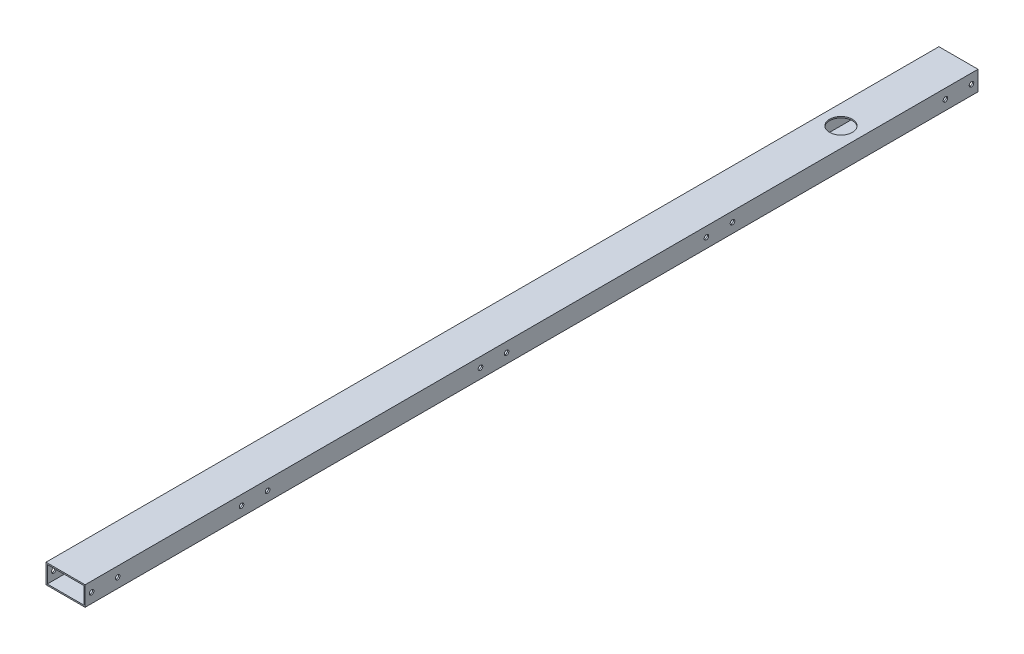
ISO-10303-21;
HEADER;
FILE_DESCRIPTION(('STEP AP214'),'2;1');
FILE_NAME('part.step','',(''),(''),'','','');
FILE_SCHEMA(('AUTOMOTIVE_DESIGN { 1 0 10303 214 1 1 1 1 }'));
ENDSEC;
DATA;
#1=APPLICATION_CONTEXT('core data for automotive mechanical design processes');
#2=APPLICATION_PROTOCOL_DEFINITION('international standard','automotive_design',2000,#1);
#3=PRODUCT_CONTEXT('',#1,'mechanical');
#4=PRODUCT('Part','Part','',(#3));
#5=PRODUCT_RELATED_PRODUCT_CATEGORY('part','',(#4));
#6=PRODUCT_DEFINITION_FORMATION('','',#4);
#7=PRODUCT_DEFINITION_CONTEXT('part definition',#1,'design');
#8=PRODUCT_DEFINITION('design','',#6,#7);
#9=PRODUCT_DEFINITION_SHAPE('','',#8);
#10=(LENGTH_UNIT() NAMED_UNIT(*) SI_UNIT(.MILLI.,.METRE.));
#11=(NAMED_UNIT(*) PLANE_ANGLE_UNIT() SI_UNIT($,.RADIAN.));
#12=(NAMED_UNIT(*) SI_UNIT($,.STERADIAN.) SOLID_ANGLE_UNIT());
#13=UNCERTAINTY_MEASURE_WITH_UNIT(LENGTH_MEASURE(1.E-05),#10,'distance_accuracy_value','');
#14=(GEOMETRIC_REPRESENTATION_CONTEXT(3) GLOBAL_UNCERTAINTY_ASSIGNED_CONTEXT((#13)) GLOBAL_UNIT_ASSIGNED_CONTEXT((#10,
#11,#12)) REPRESENTATION_CONTEXT('',''));
#15=CARTESIAN_POINT('',(0.,0.,0.));
#16=DIRECTION('',(0.,0.,1.));
#17=DIRECTION('',(1.,0.,0.));
#18=AXIS2_PLACEMENT_3D('',#15,#16,#17);
#19=CARTESIAN_POINT('',(597.365478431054,1572.85815610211,3888.85989534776));
#20=DIRECTION('',(1.,0.,0.));
#21=DIRECTION('',(0.,0.,-1.));
#22=AXIS2_PLACEMENT_3D('',#19,#20,#21);
#23=PLANE('',#22);
#24=CARTESIAN_POINT('',(597.365478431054,1587.85815610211,2528.85989534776));
#25=DIRECTION('',(-1.,0.,0.));
#26=DIRECTION('',(0.,0.,1.));
#27=AXIS2_PLACEMENT_3D('',#24,#25,#26);
#28=CIRCLE('',#27,3.49999999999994);
#29=CARTESIAN_POINT('',(597.365478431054,1587.85815610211,2532.35989534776));
#30=VERTEX_POINT('',#29);
#31=EDGE_CURVE('E301',#30,#30,#28,.T.);
#32=ORIENTED_EDGE('',*,*,#31,.T.);
#33=EDGE_LOOP('',(#32));
#34=FACE_BOUND('',#33,.T.);
#35=CARTESIAN_POINT('',(597.365478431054,1587.85815610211,3608.85989534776));
#36=DIRECTION('',(-1.,0.,0.));
#37=DIRECTION('',(0.,0.,1.));
#38=AXIS2_PLACEMENT_3D('',#35,#36,#37);
#39=CIRCLE('',#38,3.49999999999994);
#40=CARTESIAN_POINT('',(597.365478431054,1587.85815610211,3612.35989534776));
#41=VERTEX_POINT('',#40);
#42=EDGE_CURVE('E297',#41,#41,#39,.T.);
#43=ORIENTED_EDGE('',*,*,#42,.T.);
#44=EDGE_LOOP('',(#43));
#45=FACE_BOUND('',#44,.T.);
#46=CARTESIAN_POINT('',(597.365478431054,1587.85815610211,3648.85989534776));
#47=DIRECTION('',(-1.,0.,0.));
#48=DIRECTION('',(0.,0.,1.));
#49=AXIS2_PLACEMENT_3D('',#46,#47,#48);
#50=CIRCLE('',#49,3.49999999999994);
#51=CARTESIAN_POINT('',(597.365478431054,1587.85815610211,3652.35989534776));
#52=VERTEX_POINT('',#51);
#53=EDGE_CURVE('E293',#52,#52,#50,.T.);
#54=ORIENTED_EDGE('',*,*,#53,.T.);
#55=EDGE_LOOP('',(#54));
#56=FACE_BOUND('',#55,.T.);
#57=CARTESIAN_POINT('',(597.365478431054,1587.85815610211,3878.85989534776));
#58=DIRECTION('',(-1.,0.,0.));
#59=DIRECTION('',(0.,0.,1.));
#60=AXIS2_PLACEMENT_3D('',#57,#58,#59);
#61=CIRCLE('',#60,3.49999999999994);
#62=CARTESIAN_POINT('',(597.365478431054,1587.85815610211,3882.35989534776));
#63=VERTEX_POINT('',#62);
#64=EDGE_CURVE('E284',#63,#63,#61,.T.);
#65=ORIENTED_EDGE('',*,*,#64,.T.);
#66=EDGE_LOOP('',(#65));
#67=FACE_BOUND('',#66,.T.);
#68=CARTESIAN_POINT('',(597.365478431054,1587.85815610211,2935.52656201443));
#69=DIRECTION('',(-1.,0.,0.));
#70=DIRECTION('',(0.,0.,1.));
#71=AXIS2_PLACEMENT_3D('',#68,#69,#70);
#72=CIRCLE('',#71,3.49999999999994);
#73=CARTESIAN_POINT('',(597.365478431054,1587.85815610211,2939.02656201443));
#74=VERTEX_POINT('',#73);
#75=EDGE_CURVE('E288',#74,#74,#72,.T.);
#76=ORIENTED_EDGE('',*,*,#75,.T.);
#77=EDGE_LOOP('',(#76));
#78=FACE_BOUND('',#77,.T.);
#79=CARTESIAN_POINT('',(597.365478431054,1587.85815610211,2895.52656201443));
#80=DIRECTION('',(-1.,0.,0.));
#81=DIRECTION('',(0.,0.,1.));
#82=AXIS2_PLACEMENT_3D('',#79,#80,#81);
#83=CIRCLE('',#82,3.49999999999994);
#84=CARTESIAN_POINT('',(597.365478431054,1587.85815610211,2899.02656201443));
#85=VERTEX_POINT('',#84);
#86=EDGE_CURVE('E317',#85,#85,#83,.T.);
#87=ORIENTED_EDGE('',*,*,#86,.T.);
#88=EDGE_LOOP('',(#87));
#89=FACE_BOUND('',#88,.T.);
#90=CARTESIAN_POINT('',(597.365478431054,1587.85815610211,3282.1932286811));
#91=DIRECTION('',(-1.,0.,0.));
#92=DIRECTION('',(0.,0.,1.));
#93=AXIS2_PLACEMENT_3D('',#90,#91,#92);
#94=CIRCLE('',#93,3.50000000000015);
#95=CARTESIAN_POINT('',(597.365478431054,1587.85815610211,3285.6932286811));
#96=VERTEX_POINT('',#95);
#97=EDGE_CURVE('E313',#96,#96,#94,.T.);
#98=ORIENTED_EDGE('',*,*,#97,.T.);
#99=EDGE_LOOP('',(#98));
#100=FACE_BOUND('',#99,.T.);
#101=CARTESIAN_POINT('',(597.365478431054,1587.85815610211,3242.1932286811));
#102=DIRECTION('',(-1.,0.,0.));
#103=DIRECTION('',(0.,0.,1.));
#104=AXIS2_PLACEMENT_3D('',#101,#102,#103);
#105=CIRCLE('',#104,3.50000000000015);
#106=CARTESIAN_POINT('',(597.365478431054,1587.85815610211,3245.6932286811));
#107=VERTEX_POINT('',#106);
#108=EDGE_CURVE('E308',#107,#107,#105,.T.);
#109=ORIENTED_EDGE('',*,*,#108,.T.);
#110=EDGE_LOOP('',(#109));
#111=FACE_BOUND('',#110,.T.);
#112=CARTESIAN_POINT('',(597.365478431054,1587.85815610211,2568.85989534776));
#113=DIRECTION('',(-1.,0.,0.));
#114=DIRECTION('',(0.,0.,1.));
#115=AXIS2_PLACEMENT_3D('',#112,#113,#114);
#116=CIRCLE('',#115,3.49999999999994);
#117=CARTESIAN_POINT('',(597.365478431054,1587.85815610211,2572.35989534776));
#118=VERTEX_POINT('',#117);
#119=EDGE_CURVE('E279',#118,#118,#116,.T.);
#120=ORIENTED_EDGE('',*,*,#119,.T.);
#121=EDGE_LOOP('',(#120));
#122=FACE_BOUND('',#121,.T.);
#123=CARTESIAN_POINT('',(597.365478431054,1587.85815610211,3838.85989534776));
#124=DIRECTION('',(-1.,0.,0.));
#125=DIRECTION('',(0.,0.,1.));
#126=AXIS2_PLACEMENT_3D('',#123,#124,#125);
#127=CIRCLE('',#126,3.49999999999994);
#128=CARTESIAN_POINT('',(597.365478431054,1587.85815610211,3842.35989534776));
#129=VERTEX_POINT('',#128);
#130=EDGE_CURVE('E312',#129,#129,#127,.T.);
#131=ORIENTED_EDGE('',*,*,#130,.T.);
#132=EDGE_LOOP('',(#131));
#133=FACE_BOUND('',#132,.T.);
#134=DIRECTION('',(0.,-1.,0.));
#135=VECTOR('',#134,1.);
#136=CARTESIAN_POINT('',(597.365478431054,1572.85815610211,2518.85989534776));
#137=LINE('',#136,#135);
#138=CARTESIAN_POINT('',(597.365478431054,1602.85815610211,2518.85989534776));
#139=VERTEX_POINT('',#138);
#140=CARTESIAN_POINT('',(597.365478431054,1572.85815610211,2518.85989534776));
#141=VERTEX_POINT('',#140);
#142=EDGE_CURVE('E157',#139,#141,#137,.T.);
#143=ORIENTED_EDGE('',*,*,#142,.F.);
#144=DIRECTION('',(0.,0.,-1.));
#145=VECTOR('',#144,1.);
#146=CARTESIAN_POINT('',(597.365478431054,1602.85815610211,3888.85989534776));
#147=LINE('',#146,#145);
#148=CARTESIAN_POINT('',(597.365478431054,1602.85815610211,3888.85989534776));
#149=VERTEX_POINT('',#148);
#150=EDGE_CURVE('E11',#149,#139,#147,.T.);
#151=ORIENTED_EDGE('',*,*,#150,.F.);
#152=DIRECTION('',(0.,-1.,0.));
#153=VECTOR('',#152,1.);
#154=CARTESIAN_POINT('',(597.365478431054,1572.85815610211,3888.85989534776));
#155=LINE('',#154,#153);
#156=CARTESIAN_POINT('',(597.365478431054,1572.85815610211,3888.85989534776));
#157=VERTEX_POINT('',#156);
#158=EDGE_CURVE('E163',#149,#157,#155,.T.);
#159=ORIENTED_EDGE('',*,*,#158,.T.);
#160=DIRECTION('',(0.,0.,-1.));
#161=VECTOR('',#160,1.);
#162=CARTESIAN_POINT('',(597.365478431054,1572.85815610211,3888.85989534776));
#163=LINE('',#162,#161);
#164=EDGE_CURVE('E180',#157,#141,#163,.T.);
#165=ORIENTED_EDGE('',*,*,#164,.T.);
#166=EDGE_LOOP('',(#143,#151,#159,#165));
#167=FACE_BOUND('',#166,.T.);
#168=ADVANCED_FACE('F45',(#34,#45,#56,#67,#78,#89,#100,#111,#122,#133,#167),#23,.T.);
#169=CARTESIAN_POINT('',(597.365478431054,1602.85815610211,3888.85989534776));
#170=DIRECTION('',(0.,1.,0.));
#171=DIRECTION('',(0.,0.,1.));
#172=AXIS2_PLACEMENT_3D('',#169,#170,#171);
#173=PLANE('',#172);
#174=CARTESIAN_POINT('',(567.365478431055,1602.85815610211,2699.10968736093));
#175=DIRECTION('',(0.,-1.,0.));
#176=DIRECTION('',(0.,0.,-1.));
#177=AXIS2_PLACEMENT_3D('',#174,#175,#176);
#178=CIRCLE('',#177,17.4999999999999);
#179=CARTESIAN_POINT('',(567.365478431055,1602.85815610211,2681.60968736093));
#180=VERTEX_POINT('',#179);
#181=EDGE_CURVE('E218',#180,#180,#178,.T.);
#182=ORIENTED_EDGE('',*,*,#181,.T.);
#183=EDGE_LOOP('',(#182));
#184=FACE_BOUND('',#183,.T.);
#185=DIRECTION('',(1.,0.,0.));
#186=VECTOR('',#185,1.);
#187=CARTESIAN_POINT('',(597.365478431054,1602.85815610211,2518.85989534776));
#188=LINE('',#187,#186);
#189=CARTESIAN_POINT('',(537.365478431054,1602.85815610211,2518.85989534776));
#190=VERTEX_POINT('',#189);
#191=EDGE_CURVE('E168',#190,#139,#188,.T.);
#192=ORIENTED_EDGE('',*,*,#191,.F.);
#193=DIRECTION('',(0.,0.,-1.));
#194=VECTOR('',#193,1.);
#195=CARTESIAN_POINT('',(537.365478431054,1602.85815610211,3888.85989534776));
#196=LINE('',#195,#194);
#197=CARTESIAN_POINT('',(537.365478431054,1602.85815610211,3888.85989534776));
#198=VERTEX_POINT('',#197);
#199=EDGE_CURVE('E54',#198,#190,#196,.T.);
#200=ORIENTED_EDGE('',*,*,#199,.F.);
#201=DIRECTION('',(1.,0.,0.));
#202=VECTOR('',#201,1.);
#203=CARTESIAN_POINT('',(597.365478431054,1602.85815610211,3888.85989534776));
#204=LINE('',#203,#202);
#205=EDGE_CURVE('E176',#198,#149,#204,.T.);
#206=ORIENTED_EDGE('',*,*,#205,.T.);
#207=ORIENTED_EDGE('',*,*,#150,.T.);
#208=EDGE_LOOP('',(#192,#200,#206,#207));
#209=FACE_BOUND('',#208,.T.);
#210=ADVANCED_FACE('F405',(#184,#209),#173,.T.);
#211=CARTESIAN_POINT('',(537.365478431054,1572.85815610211,3888.85989534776));
#212=DIRECTION('',(-1.,0.,0.));
#213=DIRECTION('',(0.,0.,1.));
#214=AXIS2_PLACEMENT_3D('',#211,#212,#213);
#215=PLANE('',#214);
#216=CARTESIAN_POINT('',(537.365478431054,1587.85815610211,3608.85989534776));
#217=DIRECTION('',(-1.,0.,0.));
#218=DIRECTION('',(0.,0.,1.));
#219=AXIS2_PLACEMENT_3D('',#216,#217,#218);
#220=CIRCLE('',#219,10.0000000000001);
#221=CARTESIAN_POINT('',(537.365478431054,1587.85815610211,3598.85989534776));
#222=VERTEX_POINT('',#221);
#223=EDGE_CURVE('E265',#222,#222,#220,.F.);
#224=ORIENTED_EDGE('',*,*,#223,.T.);
#225=EDGE_LOOP('',(#224));
#226=FACE_BOUND('',#225,.T.);
#227=CARTESIAN_POINT('',(537.365478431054,1587.85815610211,3838.85989534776));
#228=DIRECTION('',(-1.,0.,0.));
#229=DIRECTION('',(0.,0.,1.));
#230=AXIS2_PLACEMENT_3D('',#227,#228,#229);
#231=CIRCLE('',#230,9.99999999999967);
#232=CARTESIAN_POINT('',(537.365478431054,1587.85815610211,3828.85989534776));
#233=VERTEX_POINT('',#232);
#234=EDGE_CURVE('E251',#233,#233,#231,.F.);
#235=ORIENTED_EDGE('',*,*,#234,.T.);
#236=EDGE_LOOP('',(#235));
#237=FACE_BOUND('',#236,.T.);
#238=CARTESIAN_POINT('',(537.365478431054,1587.85815610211,3282.1932286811));
#239=DIRECTION('',(-1.,0.,0.));
#240=DIRECTION('',(0.,0.,1.));
#241=AXIS2_PLACEMENT_3D('',#238,#239,#240);
#242=CIRCLE('',#241,10.0000000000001);
#243=CARTESIAN_POINT('',(537.365478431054,1587.85815610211,3272.1932286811));
#244=VERTEX_POINT('',#243);
#245=EDGE_CURVE('E247',#244,#244,#242,.F.);
#246=ORIENTED_EDGE('',*,*,#245,.T.);
#247=EDGE_LOOP('',(#246));
#248=FACE_BOUND('',#247,.T.);
#249=CARTESIAN_POINT('',(537.365478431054,1587.85815610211,3242.1932286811));
#250=DIRECTION('',(-1.,0.,0.));
#251=DIRECTION('',(0.,0.,1.));
#252=AXIS2_PLACEMENT_3D('',#249,#250,#251);
#253=CIRCLE('',#252,10.0000000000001);
#254=CARTESIAN_POINT('',(537.365478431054,1587.85815610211,3232.1932286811));
#255=VERTEX_POINT('',#254);
#256=EDGE_CURVE('E243',#255,#255,#253,.F.);
#257=ORIENTED_EDGE('',*,*,#256,.T.);
#258=EDGE_LOOP('',(#257));
#259=FACE_BOUND('',#258,.T.);
#260=CARTESIAN_POINT('',(537.365478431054,1587.85815610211,2895.52656201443));
#261=DIRECTION('',(-1.,0.,0.));
#262=DIRECTION('',(0.,0.,1.));
#263=AXIS2_PLACEMENT_3D('',#260,#261,#262);
#264=CIRCLE('',#263,10.0000000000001);
#265=CARTESIAN_POINT('',(537.365478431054,1587.85815610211,2885.52656201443));
#266=VERTEX_POINT('',#265);
#267=EDGE_CURVE('E238',#266,#266,#264,.F.);
#268=ORIENTED_EDGE('',*,*,#267,.T.);
#269=EDGE_LOOP('',(#268));
#270=FACE_BOUND('',#269,.T.);
#271=CARTESIAN_POINT('',(537.365478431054,1587.85815610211,2568.85989534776));
#272=DIRECTION('',(-1.,0.,0.));
#273=DIRECTION('',(0.,0.,1.));
#274=AXIS2_PLACEMENT_3D('',#271,#272,#273);
#275=CIRCLE('',#274,10.0000000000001);
#276=CARTESIAN_POINT('',(537.365478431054,1587.85815610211,2558.85989534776));
#277=VERTEX_POINT('',#276);
#278=EDGE_CURVE('E233',#277,#277,#275,.F.);
#279=ORIENTED_EDGE('',*,*,#278,.T.);
#280=EDGE_LOOP('',(#279));
#281=FACE_BOUND('',#280,.T.);
#282=CARTESIAN_POINT('',(537.365478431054,1587.85815610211,2935.52656201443));
#283=DIRECTION('',(-1.,0.,0.));
#284=DIRECTION('',(0.,0.,1.));
#285=AXIS2_PLACEMENT_3D('',#282,#283,#284);
#286=CIRCLE('',#285,10.0000000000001);
#287=CARTESIAN_POINT('',(537.365478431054,1587.85815610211,2925.52656201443));
#288=VERTEX_POINT('',#287);
#289=EDGE_CURVE('E228',#288,#288,#286,.F.);
#290=ORIENTED_EDGE('',*,*,#289,.T.);
#291=EDGE_LOOP('',(#290));
#292=FACE_BOUND('',#291,.T.);
#293=CARTESIAN_POINT('',(537.365478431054,1587.85815610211,3648.85989534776));
#294=DIRECTION('',(-1.,0.,0.));
#295=DIRECTION('',(0.,0.,1.));
#296=AXIS2_PLACEMENT_3D('',#293,#294,#295);
#297=CIRCLE('',#296,10.0000000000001);
#298=CARTESIAN_POINT('',(537.365478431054,1587.85815610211,3638.85989534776));
#299=VERTEX_POINT('',#298);
#300=EDGE_CURVE('E223',#299,#299,#297,.F.);
#301=ORIENTED_EDGE('',*,*,#300,.T.);
#302=EDGE_LOOP('',(#301));
#303=FACE_BOUND('',#302,.T.);
#304=CARTESIAN_POINT('',(537.365478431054,1587.85815610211,2528.85989534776));
#305=DIRECTION('',(-1.,0.,0.));
#306=DIRECTION('',(0.,0.,1.));
#307=AXIS2_PLACEMENT_3D('',#304,#305,#306);
#308=CIRCLE('',#307,3.49999999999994);
#309=CARTESIAN_POINT('',(537.365478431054,1587.85815610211,2532.35989534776));
#310=VERTEX_POINT('',#309);
#311=EDGE_CURVE('E283',#310,#310,#308,.T.);
#312=ORIENTED_EDGE('',*,*,#311,.F.);
#313=EDGE_LOOP('',(#312));
#314=FACE_BOUND('',#313,.T.);
#315=CARTESIAN_POINT('',(537.365478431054,1587.85815610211,3878.85989534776));
#316=DIRECTION('',(-1.,0.,0.));
#317=DIRECTION('',(0.,0.,1.));
#318=AXIS2_PLACEMENT_3D('',#315,#316,#317);
#319=CIRCLE('',#318,3.49999999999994);
#320=CARTESIAN_POINT('',(537.365478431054,1587.85815610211,3882.35989534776));
#321=VERTEX_POINT('',#320);
#322=EDGE_CURVE('E289',#321,#321,#319,.T.);
#323=ORIENTED_EDGE('',*,*,#322,.F.);
#324=EDGE_LOOP('',(#323));
#325=FACE_BOUND('',#324,.T.);
#326=DIRECTION('',(0.,1.,0.));
#327=VECTOR('',#326,1.);
#328=CARTESIAN_POINT('',(537.365478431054,1572.85815610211,2518.85989534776));
#329=LINE('',#328,#327);
#330=CARTESIAN_POINT('',(537.365478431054,1572.85815610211,2518.85989534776));
#331=VERTEX_POINT('',#330);
#332=EDGE_CURVE('E188',#331,#190,#329,.T.);
#333=ORIENTED_EDGE('',*,*,#332,.F.);
#334=DIRECTION('',(0.,0.,-1.));
#335=VECTOR('',#334,1.);
#336=CARTESIAN_POINT('',(537.365478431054,1572.85815610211,3888.85989534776));
#337=LINE('',#336,#335);
#338=CARTESIAN_POINT('',(537.365478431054,1572.85815610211,3888.85989534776));
#339=VERTEX_POINT('',#338);
#340=EDGE_CURVE('E197',#339,#331,#337,.T.);
#341=ORIENTED_EDGE('',*,*,#340,.F.);
#342=DIRECTION('',(0.,1.,0.));
#343=VECTOR('',#342,1.);
#344=CARTESIAN_POINT('',(537.365478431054,1572.85815610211,3888.85989534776));
#345=LINE('',#344,#343);
#346=EDGE_CURVE('E172',#339,#198,#345,.T.);
#347=ORIENTED_EDGE('',*,*,#346,.T.);
#348=ORIENTED_EDGE('',*,*,#199,.T.);
#349=EDGE_LOOP('',(#333,#341,#347,#348));
#350=FACE_BOUND('',#349,.T.);
#351=ADVANCED_FACE('F411',(#226,#237,#248,#259,#270,#281,#292,#303,#314,#325,#350),#215,.T.);
#352=CARTESIAN_POINT('',(597.365478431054,1572.85815610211,3888.85989534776));
#353=DIRECTION('',(0.,-1.,0.));
#354=DIRECTION('',(0.,0.,-1.));
#355=AXIS2_PLACEMENT_3D('',#352,#353,#354);
#356=PLANE('',#355);
#357=CARTESIAN_POINT('',(567.365478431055,1572.85815610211,2699.10968736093));
#358=DIRECTION('',(0.,-1.,0.));
#359=DIRECTION('',(0.,0.,-1.));
#360=AXIS2_PLACEMENT_3D('',#357,#358,#359);
#361=CIRCLE('',#360,17.4999999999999);
#362=CARTESIAN_POINT('',(567.365478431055,1572.85815610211,2681.60968736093));
#363=VERTEX_POINT('',#362);
#364=EDGE_CURVE('E269',#363,#363,#361,.T.);
#365=ORIENTED_EDGE('',*,*,#364,.F.);
#366=EDGE_LOOP('',(#365));
#367=FACE_BOUND('',#366,.T.);
#368=DIRECTION('',(-1.,0.,0.));
#369=VECTOR('',#368,1.);
#370=CARTESIAN_POINT('',(597.365478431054,1572.85815610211,2518.85989534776));
#371=LINE('',#370,#369);
#372=EDGE_CURVE('E184',#141,#331,#371,.T.);
#373=ORIENTED_EDGE('',*,*,#372,.F.);
#374=ORIENTED_EDGE('',*,*,#164,.F.);
#375=DIRECTION('',(-1.,0.,0.));
#376=VECTOR('',#375,1.);
#377=CARTESIAN_POINT('',(597.365478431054,1572.85815610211,3888.85989534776));
#378=LINE('',#377,#376);
#379=EDGE_CURVE('E167',#157,#339,#378,.T.);
#380=ORIENTED_EDGE('',*,*,#379,.T.);
#381=ORIENTED_EDGE('',*,*,#340,.T.);
#382=EDGE_LOOP('',(#373,#374,#380,#381));
#383=FACE_BOUND('',#382,.T.);
#384=ADVANCED_FACE('F444',(#367,#383),#356,.T.);
#385=CARTESIAN_POINT('',(0.,0.,3888.85989534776));
#386=DIRECTION('',(0.,0.,1.));
#387=DIRECTION('',(1.,0.,0.));
#388=AXIS2_PLACEMENT_3D('',#385,#386,#387);
#389=PLANE('',#388);
#390=DIRECTION('',(0.,-1.,0.));
#391=VECTOR('',#390,1.);
#392=CARTESIAN_POINT('',(595.365478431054,1574.85815610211,3888.85989534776));
#393=LINE('',#392,#391);
#394=CARTESIAN_POINT('',(595.365478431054,1600.85815610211,3888.85989534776));
#395=VERTEX_POINT('',#394);
#396=CARTESIAN_POINT('',(595.365478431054,1574.85815610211,3888.85989534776));
#397=VERTEX_POINT('',#396);
#398=EDGE_CURVE('E113',#395,#397,#393,.T.);
#399=ORIENTED_EDGE('',*,*,#398,.T.);
#400=DIRECTION('',(-1.,0.,0.));
#401=VECTOR('',#400,1.);
#402=CARTESIAN_POINT('',(595.365478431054,1574.85815610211,3888.85989534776));
#403=LINE('',#402,#401);
#404=CARTESIAN_POINT('',(539.365478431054,1574.85815610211,3888.85989534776));
#405=VERTEX_POINT('',#404);
#406=EDGE_CURVE('E123',#397,#405,#403,.T.);
#407=ORIENTED_EDGE('',*,*,#406,.T.);
#408=DIRECTION('',(0.,1.,0.));
#409=VECTOR('',#408,1.);
#410=CARTESIAN_POINT('',(539.365478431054,1574.85815610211,3888.85989534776));
#411=LINE('',#410,#409);
#412=CARTESIAN_POINT('',(539.365478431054,1600.85815610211,3888.85989534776));
#413=VERTEX_POINT('',#412);
#414=EDGE_CURVE('E62',#405,#413,#411,.T.);
#415=ORIENTED_EDGE('',*,*,#414,.T.);
#416=DIRECTION('',(1.,0.,0.));
#417=VECTOR('',#416,1.);
#418=CARTESIAN_POINT('',(595.365478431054,1600.85815610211,3888.85989534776));
#419=LINE('',#418,#417);
#420=EDGE_CURVE('E120',#413,#395,#419,.T.);
#421=ORIENTED_EDGE('',*,*,#420,.T.);
#422=EDGE_LOOP('',(#399,#407,#415,#421));
#423=FACE_BOUND('',#422,.T.);
#424=ORIENTED_EDGE('',*,*,#158,.F.);
#425=ORIENTED_EDGE('',*,*,#205,.F.);
#426=ORIENTED_EDGE('',*,*,#346,.F.);
#427=ORIENTED_EDGE('',*,*,#379,.F.);
#428=EDGE_LOOP('',(#424,#425,#426,#427));
#429=FACE_BOUND('',#428,.T.);
#430=ADVANCED_FACE('F128',(#423,#429),#389,.T.);
#431=CARTESIAN_POINT('',(0.,0.,2518.85989534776));
#432=DIRECTION('',(0.,0.,1.));
#433=DIRECTION('',(1.,0.,0.));
#434=AXIS2_PLACEMENT_3D('',#431,#432,#433);
#435=PLANE('',#434);
#436=DIRECTION('',(-1.,0.,0.));
#437=VECTOR('',#436,1.);
#438=CARTESIAN_POINT('',(595.365478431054,1574.85815610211,2518.85989534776));
#439=LINE('',#438,#437);
#440=CARTESIAN_POINT('',(595.365478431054,1574.85815610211,2518.85989534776));
#441=VERTEX_POINT('',#440);
#442=CARTESIAN_POINT('',(539.365478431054,1574.85815610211,2518.85989534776));
#443=VERTEX_POINT('',#442);
#444=EDGE_CURVE('E148',#441,#443,#439,.T.);
#445=ORIENTED_EDGE('',*,*,#444,.F.);
#446=DIRECTION('',(0.,-1.,0.));
#447=VECTOR('',#446,1.);
#448=CARTESIAN_POINT('',(595.365478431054,1574.85815610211,2518.85989534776));
#449=LINE('',#448,#447);
#450=CARTESIAN_POINT('',(595.365478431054,1600.85815610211,2518.85989534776));
#451=VERTEX_POINT('',#450);
#452=EDGE_CURVE('E70',#451,#441,#449,.T.);
#453=ORIENTED_EDGE('',*,*,#452,.F.);
#454=DIRECTION('',(1.,0.,0.));
#455=VECTOR('',#454,1.);
#456=CARTESIAN_POINT('',(595.365478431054,1600.85815610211,2518.85989534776));
#457=LINE('',#456,#455);
#458=CARTESIAN_POINT('',(539.365478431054,1600.85815610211,2518.85989534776));
#459=VERTEX_POINT('',#458);
#460=EDGE_CURVE('E132',#459,#451,#457,.T.);
#461=ORIENTED_EDGE('',*,*,#460,.F.);
#462=DIRECTION('',(0.,1.,0.));
#463=VECTOR('',#462,1.);
#464=CARTESIAN_POINT('',(539.365478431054,1574.85815610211,2518.85989534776));
#465=LINE('',#464,#463);
#466=EDGE_CURVE('E136',#443,#459,#465,.T.);
#467=ORIENTED_EDGE('',*,*,#466,.F.);
#468=EDGE_LOOP('',(#445,#453,#461,#467));
#469=FACE_BOUND('',#468,.T.);
#470=ORIENTED_EDGE('',*,*,#142,.T.);
#471=ORIENTED_EDGE('',*,*,#372,.T.);
#472=ORIENTED_EDGE('',*,*,#332,.T.);
#473=ORIENTED_EDGE('',*,*,#191,.T.);
#474=EDGE_LOOP('',(#470,#471,#472,#473));
#475=FACE_BOUND('',#474,.T.);
#476=ADVANCED_FACE('F365',(#469,#475),#435,.F.);
#477=CARTESIAN_POINT('',(595.365478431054,1574.85815610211,3888.85989534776));
#478=DIRECTION('',(1.,0.,0.));
#479=DIRECTION('',(0.,0.,-1.));
#480=AXIS2_PLACEMENT_3D('',#477,#478,#479);
#481=PLANE('',#480);
#482=CARTESIAN_POINT('',(595.365478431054,1587.85815610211,2528.85989534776));
#483=DIRECTION('',(1.,0.,0.));
#484=DIRECTION('',(0.,0.,-1.));
#485=AXIS2_PLACEMENT_3D('',#482,#483,#484);
#486=CIRCLE('',#485,3.49999999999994);
#487=CARTESIAN_POINT('',(595.365478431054,1587.85815610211,2525.35989534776));
#488=VERTEX_POINT('',#487);
#489=EDGE_CURVE('E139',#488,#488,#486,.F.);
#490=ORIENTED_EDGE('',*,*,#489,.F.);
#491=EDGE_LOOP('',(#490));
#492=FACE_BOUND('',#491,.T.);
#493=CARTESIAN_POINT('',(595.365478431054,1587.85815610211,3608.85989534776));
#494=DIRECTION('',(1.,0.,0.));
#495=DIRECTION('',(0.,0.,-1.));
#496=AXIS2_PLACEMENT_3D('',#493,#494,#495);
#497=CIRCLE('',#496,3.49999999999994);
#498=CARTESIAN_POINT('',(595.365478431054,1587.85815610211,3605.35989534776));
#499=VERTEX_POINT('',#498);
#500=EDGE_CURVE('E212',#499,#499,#497,.F.);
#501=ORIENTED_EDGE('',*,*,#500,.F.);
#502=EDGE_LOOP('',(#501));
#503=FACE_BOUND('',#502,.T.);
#504=CARTESIAN_POINT('',(595.365478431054,1587.85815610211,3648.85989534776));
#505=DIRECTION('',(1.,0.,0.));
#506=DIRECTION('',(0.,0.,-1.));
#507=AXIS2_PLACEMENT_3D('',#504,#505,#506);
#508=CIRCLE('',#507,3.49999999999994);
#509=CARTESIAN_POINT('',(595.365478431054,1587.85815610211,3645.35989534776));
#510=VERTEX_POINT('',#509);
#511=EDGE_CURVE('E353',#510,#510,#508,.F.);
#512=ORIENTED_EDGE('',*,*,#511,.F.);
#513=EDGE_LOOP('',(#512));
#514=FACE_BOUND('',#513,.T.);
#515=CARTESIAN_POINT('',(595.365478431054,1587.85815610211,3878.85989534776));
#516=DIRECTION('',(1.,0.,0.));
#517=DIRECTION('',(0.,0.,-1.));
#518=AXIS2_PLACEMENT_3D('',#515,#516,#517);
#519=CIRCLE('',#518,3.49999999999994);
#520=CARTESIAN_POINT('',(595.365478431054,1587.85815610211,3875.35989534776));
#521=VERTEX_POINT('',#520);
#522=EDGE_CURVE('E206',#521,#521,#519,.F.);
#523=ORIENTED_EDGE('',*,*,#522,.F.);
#524=EDGE_LOOP('',(#523));
#525=FACE_BOUND('',#524,.T.);
#526=CARTESIAN_POINT('',(595.365478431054,1587.85815610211,2935.52656201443));
#527=DIRECTION('',(1.,0.,0.));
#528=DIRECTION('',(0.,0.,-1.));
#529=AXIS2_PLACEMENT_3D('',#526,#527,#528);
#530=CIRCLE('',#529,3.49999999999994);
#531=CARTESIAN_POINT('',(595.365478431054,1587.85815610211,2932.02656201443));
#532=VERTEX_POINT('',#531);
#533=EDGE_CURVE('E207',#532,#532,#530,.F.);
#534=ORIENTED_EDGE('',*,*,#533,.F.);
#535=EDGE_LOOP('',(#534));
#536=FACE_BOUND('',#535,.T.);
#537=CARTESIAN_POINT('',(595.365478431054,1587.85815610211,2895.52656201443));
#538=DIRECTION('',(1.,0.,0.));
#539=DIRECTION('',(0.,0.,-1.));
#540=AXIS2_PLACEMENT_3D('',#537,#538,#539);
#541=CIRCLE('',#540,3.49999999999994);
#542=CARTESIAN_POINT('',(595.365478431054,1587.85815610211,2892.02656201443));
#543=VERTEX_POINT('',#542);
#544=EDGE_CURVE('E343',#543,#543,#541,.F.);
#545=ORIENTED_EDGE('',*,*,#544,.F.);
#546=EDGE_LOOP('',(#545));
#547=FACE_BOUND('',#546,.T.);
#548=CARTESIAN_POINT('',(595.365478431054,1587.85815610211,3282.1932286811));
#549=DIRECTION('',(1.,0.,0.));
#550=DIRECTION('',(0.,0.,-1.));
#551=AXIS2_PLACEMENT_3D('',#548,#549,#550);
#552=CIRCLE('',#551,3.50000000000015);
#553=CARTESIAN_POINT('',(595.365478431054,1587.85815610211,3278.6932286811));
#554=VERTEX_POINT('',#553);
#555=EDGE_CURVE('E339',#554,#554,#552,.F.);
#556=ORIENTED_EDGE('',*,*,#555,.F.);
#557=EDGE_LOOP('',(#556));
#558=FACE_BOUND('',#557,.T.);
#559=CARTESIAN_POINT('',(595.365478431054,1587.85815610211,3242.1932286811));
#560=DIRECTION('',(1.,0.,0.));
#561=DIRECTION('',(0.,0.,-1.));
#562=AXIS2_PLACEMENT_3D('',#559,#560,#561);
#563=CIRCLE('',#562,3.50000000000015);
#564=CARTESIAN_POINT('',(595.365478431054,1587.85815610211,3238.6932286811));
#565=VERTEX_POINT('',#564);
#566=EDGE_CURVE('E335',#565,#565,#563,.F.);
#567=ORIENTED_EDGE('',*,*,#566,.F.);
#568=EDGE_LOOP('',(#567));
#569=FACE_BOUND('',#568,.T.);
#570=CARTESIAN_POINT('',(595.365478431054,1587.85815610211,2568.85989534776));
#571=DIRECTION('',(1.,0.,0.));
#572=DIRECTION('',(0.,0.,-1.));
#573=AXIS2_PLACEMENT_3D('',#570,#571,#572);
#574=CIRCLE('',#573,3.49999999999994);
#575=CARTESIAN_POINT('',(595.365478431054,1587.85815610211,2565.35989534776));
#576=VERTEX_POINT('',#575);
#577=EDGE_CURVE('E331',#576,#576,#574,.F.);
#578=ORIENTED_EDGE('',*,*,#577,.F.);
#579=EDGE_LOOP('',(#578));
#580=FACE_BOUND('',#579,.T.);
#581=CARTESIAN_POINT('',(595.365478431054,1587.85815610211,3838.85989534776));
#582=DIRECTION('',(1.,0.,0.));
#583=DIRECTION('',(0.,0.,-1.));
#584=AXIS2_PLACEMENT_3D('',#581,#582,#583);
#585=CIRCLE('',#584,3.49999999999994);
#586=CARTESIAN_POINT('',(595.365478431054,1587.85815610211,3835.35989534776));
#587=VERTEX_POINT('',#586);
#588=EDGE_CURVE('E327',#587,#587,#585,.F.);
#589=ORIENTED_EDGE('',*,*,#588,.F.);
#590=EDGE_LOOP('',(#589));
#591=FACE_BOUND('',#590,.T.);
#592=ORIENTED_EDGE('',*,*,#452,.T.);
#593=DIRECTION('',(0.,0.,-1.));
#594=VECTOR('',#593,1.);
#595=CARTESIAN_POINT('',(595.365478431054,1574.85815610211,3888.85989534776));
#596=LINE('',#595,#594);
#597=EDGE_CURVE('E109',#397,#441,#596,.T.);
#598=ORIENTED_EDGE('',*,*,#597,.F.);
#599=ORIENTED_EDGE('',*,*,#398,.F.);
#600=DIRECTION('',(0.,0.,-1.));
#601=VECTOR('',#600,1.);
#602=CARTESIAN_POINT('',(595.365478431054,1600.85815610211,3888.85989534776));
#603=LINE('',#602,#601);
#604=EDGE_CURVE('E154',#395,#451,#603,.T.);
#605=ORIENTED_EDGE('',*,*,#604,.T.);
#606=EDGE_LOOP('',(#592,#598,#599,#605));
#607=FACE_BOUND('',#606,.T.);
#608=ADVANCED_FACE('F111',(#492,#503,#514,#525,#536,#547,#558,#569,#580,#591,#607),#481,.F.);
#609=CARTESIAN_POINT('',(595.365478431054,1600.85815610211,3888.85989534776));
#610=DIRECTION('',(0.,1.,0.));
#611=DIRECTION('',(0.,0.,1.));
#612=AXIS2_PLACEMENT_3D('',#609,#610,#611);
#613=PLANE('',#612);
#614=CARTESIAN_POINT('',(567.365478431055,1600.85815610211,2699.10968736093));
#615=DIRECTION('',(0.,1.,0.));
#616=DIRECTION('',(0.,0.,1.));
#617=AXIS2_PLACEMENT_3D('',#614,#615,#616);
#618=CIRCLE('',#617,17.4999999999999);
#619=CARTESIAN_POINT('',(567.365478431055,1600.85815610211,2716.60968736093));
#620=VERTEX_POINT('',#619);
#621=EDGE_CURVE('E217',#620,#620,#618,.T.);
#622=ORIENTED_EDGE('',*,*,#621,.T.);
#623=EDGE_LOOP('',(#622));
#624=FACE_BOUND('',#623,.T.);
#625=ORIENTED_EDGE('',*,*,#460,.T.);
#626=ORIENTED_EDGE('',*,*,#604,.F.);
#627=ORIENTED_EDGE('',*,*,#420,.F.);
#628=DIRECTION('',(0.,0.,-1.));
#629=VECTOR('',#628,1.);
#630=CARTESIAN_POINT('',(539.365478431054,1600.85815610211,3888.85989534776));
#631=LINE('',#630,#629);
#632=EDGE_CURVE('E158',#413,#459,#631,.T.);
#633=ORIENTED_EDGE('',*,*,#632,.T.);
#634=EDGE_LOOP('',(#625,#626,#627,#633));
#635=FACE_BOUND('',#634,.T.);
#636=ADVANCED_FACE('F364',(#624,#635),#613,.F.);
#637=CARTESIAN_POINT('',(539.365478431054,1574.85815610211,3888.85989534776));
#638=DIRECTION('',(-1.,0.,0.));
#639=DIRECTION('',(0.,0.,1.));
#640=AXIS2_PLACEMENT_3D('',#637,#638,#639);
#641=PLANE('',#640);
#642=CARTESIAN_POINT('',(539.365478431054,1587.85815610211,3608.85989534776));
#643=DIRECTION('',(-1.,0.,0.));
#644=DIRECTION('',(0.,0.,1.));
#645=AXIS2_PLACEMENT_3D('',#642,#643,#644);
#646=CIRCLE('',#645,10.0000000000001);
#647=CARTESIAN_POINT('',(539.365478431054,1587.85815610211,3598.85989534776));
#648=VERTEX_POINT('',#647);
#649=EDGE_CURVE('E48',#648,#648,#646,.F.);
#650=ORIENTED_EDGE('',*,*,#649,.F.);
#651=EDGE_LOOP('',(#650));
#652=FACE_BOUND('',#651,.T.);
#653=CARTESIAN_POINT('',(539.365478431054,1587.85815610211,3838.85989534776));
#654=DIRECTION('',(-1.,0.,0.));
#655=DIRECTION('',(0.,0.,1.));
#656=AXIS2_PLACEMENT_3D('',#653,#654,#655);
#657=CIRCLE('',#656,9.99999999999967);
#658=CARTESIAN_POINT('',(539.365478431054,1587.85815610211,3828.85989534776));
#659=VERTEX_POINT('',#658);
#660=EDGE_CURVE('E248',#659,#659,#657,.F.);
#661=ORIENTED_EDGE('',*,*,#660,.F.);
#662=EDGE_LOOP('',(#661));
#663=FACE_BOUND('',#662,.T.);
#664=CARTESIAN_POINT('',(539.365478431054,1587.85815610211,3282.1932286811));
#665=DIRECTION('',(-1.,0.,0.));
#666=DIRECTION('',(0.,0.,1.));
#667=AXIS2_PLACEMENT_3D('',#664,#665,#666);
#668=CIRCLE('',#667,10.0000000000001);
#669=CARTESIAN_POINT('',(539.365478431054,1587.85815610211,3272.1932286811));
#670=VERTEX_POINT('',#669);
#671=EDGE_CURVE('E244',#670,#670,#668,.F.);
#672=ORIENTED_EDGE('',*,*,#671,.F.);
#673=EDGE_LOOP('',(#672));
#674=FACE_BOUND('',#673,.T.);
#675=CARTESIAN_POINT('',(539.365478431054,1587.85815610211,3242.1932286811));
#676=DIRECTION('',(-1.,0.,0.));
#677=DIRECTION('',(0.,0.,1.));
#678=AXIS2_PLACEMENT_3D('',#675,#676,#677);
#679=CIRCLE('',#678,10.0000000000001);
#680=CARTESIAN_POINT('',(539.365478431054,1587.85815610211,3232.1932286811));
#681=VERTEX_POINT('',#680);
#682=EDGE_CURVE('E239',#681,#681,#679,.F.);
#683=ORIENTED_EDGE('',*,*,#682,.F.);
#684=EDGE_LOOP('',(#683));
#685=FACE_BOUND('',#684,.T.);
#686=CARTESIAN_POINT('',(539.365478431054,1587.85815610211,2895.52656201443));
#687=DIRECTION('',(-1.,0.,0.));
#688=DIRECTION('',(0.,0.,1.));
#689=AXIS2_PLACEMENT_3D('',#686,#687,#688);
#690=CIRCLE('',#689,10.0000000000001);
#691=CARTESIAN_POINT('',(539.365478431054,1587.85815610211,2885.52656201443));
#692=VERTEX_POINT('',#691);
#693=EDGE_CURVE('E234',#692,#692,#690,.F.);
#694=ORIENTED_EDGE('',*,*,#693,.F.);
#695=EDGE_LOOP('',(#694));
#696=FACE_BOUND('',#695,.T.);
#697=CARTESIAN_POINT('',(539.365478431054,1587.85815610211,2568.85989534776));
#698=DIRECTION('',(-1.,0.,0.));
#699=DIRECTION('',(0.,0.,1.));
#700=AXIS2_PLACEMENT_3D('',#697,#698,#699);
#701=CIRCLE('',#700,10.0000000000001);
#702=CARTESIAN_POINT('',(539.365478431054,1587.85815610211,2558.85989534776));
#703=VERTEX_POINT('',#702);
#704=EDGE_CURVE('E229',#703,#703,#701,.F.);
#705=ORIENTED_EDGE('',*,*,#704,.F.);
#706=EDGE_LOOP('',(#705));
#707=FACE_BOUND('',#706,.T.);
#708=CARTESIAN_POINT('',(539.365478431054,1587.85815610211,2935.52656201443));
#709=DIRECTION('',(-1.,0.,0.));
#710=DIRECTION('',(0.,0.,1.));
#711=AXIS2_PLACEMENT_3D('',#708,#709,#710);
#712=CIRCLE('',#711,10.0000000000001);
#713=CARTESIAN_POINT('',(539.365478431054,1587.85815610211,2925.52656201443));
#714=VERTEX_POINT('',#713);
#715=EDGE_CURVE('E224',#714,#714,#712,.F.);
#716=ORIENTED_EDGE('',*,*,#715,.F.);
#717=EDGE_LOOP('',(#716));
#718=FACE_BOUND('',#717,.T.);
#719=CARTESIAN_POINT('',(539.365478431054,1587.85815610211,3648.85989534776));
#720=DIRECTION('',(-1.,0.,0.));
#721=DIRECTION('',(0.,0.,1.));
#722=AXIS2_PLACEMENT_3D('',#719,#720,#721);
#723=CIRCLE('',#722,10.0000000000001);
#724=CARTESIAN_POINT('',(539.365478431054,1587.85815610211,3638.85989534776));
#725=VERTEX_POINT('',#724);
#726=EDGE_CURVE('E219',#725,#725,#723,.F.);
#727=ORIENTED_EDGE('',*,*,#726,.F.);
#728=EDGE_LOOP('',(#727));
#729=FACE_BOUND('',#728,.T.);
#730=CARTESIAN_POINT('',(539.365478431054,1587.85815610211,2528.85989534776));
#731=DIRECTION('',(-1.,0.,0.));
#732=DIRECTION('',(0.,0.,1.));
#733=AXIS2_PLACEMENT_3D('',#730,#731,#732);
#734=CIRCLE('',#733,3.49999999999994);
#735=CARTESIAN_POINT('',(539.365478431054,1587.85815610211,2532.35989534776));
#736=VERTEX_POINT('',#735);
#737=EDGE_CURVE('E208',#736,#736,#734,.F.);
#738=ORIENTED_EDGE('',*,*,#737,.F.);
#739=EDGE_LOOP('',(#738));
#740=FACE_BOUND('',#739,.T.);
#741=CARTESIAN_POINT('',(539.365478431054,1587.85815610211,3878.85989534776));
#742=DIRECTION('',(-1.,0.,0.));
#743=DIRECTION('',(0.,0.,1.));
#744=AXIS2_PLACEMENT_3D('',#741,#742,#743);
#745=CIRCLE('',#744,3.49999999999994);
#746=CARTESIAN_POINT('',(539.365478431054,1587.85815610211,3882.35989534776));
#747=VERTEX_POINT('',#746);
#748=EDGE_CURVE('E202',#747,#747,#745,.F.);
#749=ORIENTED_EDGE('',*,*,#748,.F.);
#750=EDGE_LOOP('',(#749));
#751=FACE_BOUND('',#750,.T.);
#752=ORIENTED_EDGE('',*,*,#466,.T.);
#753=ORIENTED_EDGE('',*,*,#632,.F.);
#754=ORIENTED_EDGE('',*,*,#414,.F.);
#755=DIRECTION('',(0.,0.,-1.));
#756=VECTOR('',#755,1.);
#757=CARTESIAN_POINT('',(539.365478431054,1574.85815610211,3888.85989534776));
#758=LINE('',#757,#756);
#759=EDGE_CURVE('E119',#405,#443,#758,.T.);
#760=ORIENTED_EDGE('',*,*,#759,.T.);
#761=EDGE_LOOP('',(#752,#753,#754,#760));
#762=FACE_BOUND('',#761,.T.);
#763=ADVANCED_FACE('F463',(#652,#663,#674,#685,#696,#707,#718,#729,#740,#751,#762),#641,.F.);
#764=CARTESIAN_POINT('',(595.365478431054,1574.85815610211,3888.85989534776));
#765=DIRECTION('',(0.,-1.,0.));
#766=DIRECTION('',(0.,0.,-1.));
#767=AXIS2_PLACEMENT_3D('',#764,#765,#766);
#768=PLANE('',#767);
#769=CARTESIAN_POINT('',(567.365478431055,1574.85815610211,2699.10968736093));
#770=DIRECTION('',(0.,-1.,0.));
#771=DIRECTION('',(0.,0.,-1.));
#772=AXIS2_PLACEMENT_3D('',#769,#770,#771);
#773=CIRCLE('',#772,17.4999999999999);
#774=CARTESIAN_POINT('',(567.365478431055,1574.85815610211,2681.60968736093));
#775=VERTEX_POINT('',#774);
#776=EDGE_CURVE('E213',#775,#775,#773,.T.);
#777=ORIENTED_EDGE('',*,*,#776,.T.);
#778=EDGE_LOOP('',(#777));
#779=FACE_BOUND('',#778,.T.);
#780=ORIENTED_EDGE('',*,*,#444,.T.);
#781=ORIENTED_EDGE('',*,*,#759,.F.);
#782=ORIENTED_EDGE('',*,*,#406,.F.);
#783=ORIENTED_EDGE('',*,*,#597,.T.);
#784=EDGE_LOOP('',(#780,#781,#782,#783));
#785=FACE_BOUND('',#784,.T.);
#786=ADVANCED_FACE('F124',(#779,#785),#768,.F.);
#787=CARTESIAN_POINT('',(537.365478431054,1587.85815610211,3878.85989534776));
#788=DIRECTION('',(1.,0.,0.));
#789=DIRECTION('',(0.,0.,-1.));
#790=AXIS2_PLACEMENT_3D('',#787,#788,#789);
#791=CYLINDRICAL_SURFACE('',#790,3.49999999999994);
#792=ORIENTED_EDGE('',*,*,#322,.T.);
#793=EDGE_LOOP('',(#792));
#794=FACE_BOUND('',#793,.T.);
#795=ORIENTED_EDGE('',*,*,#748,.T.);
#796=EDGE_LOOP('',(#795));
#797=FACE_BOUND('',#796,.T.);
#798=ADVANCED_FACE('F397',(#794,#797),#791,.F.);
#799=CARTESIAN_POINT('',(537.365478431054,1587.85815610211,2528.85989534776));
#800=DIRECTION('',(1.,0.,0.));
#801=DIRECTION('',(0.,0.,-1.));
#802=AXIS2_PLACEMENT_3D('',#799,#800,#801);
#803=CYLINDRICAL_SURFACE('',#802,3.49999999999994);
#804=ORIENTED_EDGE('',*,*,#311,.T.);
#805=EDGE_LOOP('',(#804));
#806=FACE_BOUND('',#805,.T.);
#807=ORIENTED_EDGE('',*,*,#737,.T.);
#808=EDGE_LOOP('',(#807));
#809=FACE_BOUND('',#808,.T.);
#810=ADVANCED_FACE('F387',(#806,#809),#803,.F.);
#811=CARTESIAN_POINT('',(537.365478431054,1587.85815610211,3838.85989534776));
#812=DIRECTION('',(1.,0.,0.));
#813=DIRECTION('',(0.,0.,-1.));
#814=AXIS2_PLACEMENT_3D('',#811,#812,#813);
#815=CYLINDRICAL_SURFACE('',#814,3.49999999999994);
#816=ORIENTED_EDGE('',*,*,#130,.F.);
#817=EDGE_LOOP('',(#816));
#818=FACE_BOUND('',#817,.T.);
#819=ORIENTED_EDGE('',*,*,#588,.T.);
#820=EDGE_LOOP('',(#819));
#821=FACE_BOUND('',#820,.T.);
#822=ADVANCED_FACE('F384',(#818,#821),#815,.F.);
#823=CARTESIAN_POINT('',(537.365478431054,1587.85815610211,2568.85989534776));
#824=DIRECTION('',(1.,0.,0.));
#825=DIRECTION('',(0.,0.,-1.));
#826=AXIS2_PLACEMENT_3D('',#823,#824,#825);
#827=CYLINDRICAL_SURFACE('',#826,3.49999999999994);
#828=ORIENTED_EDGE('',*,*,#119,.F.);
#829=EDGE_LOOP('',(#828));
#830=FACE_BOUND('',#829,.T.);
#831=ORIENTED_EDGE('',*,*,#577,.T.);
#832=EDGE_LOOP('',(#831));
#833=FACE_BOUND('',#832,.T.);
#834=ADVANCED_FACE('F386',(#830,#833),#827,.F.);
#835=CARTESIAN_POINT('',(537.365478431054,1587.85815610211,3242.1932286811));
#836=DIRECTION('',(1.,0.,0.));
#837=DIRECTION('',(0.,0.,-1.));
#838=AXIS2_PLACEMENT_3D('',#835,#836,#837);
#839=CYLINDRICAL_SURFACE('',#838,3.50000000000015);
#840=ORIENTED_EDGE('',*,*,#108,.F.);
#841=EDGE_LOOP('',(#840));
#842=FACE_BOUND('',#841,.T.);
#843=ORIENTED_EDGE('',*,*,#566,.T.);
#844=EDGE_LOOP('',(#843));
#845=FACE_BOUND('',#844,.T.);
#846=ADVANCED_FACE('F394',(#842,#845),#839,.F.);
#847=CARTESIAN_POINT('',(537.365478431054,1587.85815610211,3282.1932286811));
#848=DIRECTION('',(1.,0.,0.));
#849=DIRECTION('',(0.,0.,-1.));
#850=AXIS2_PLACEMENT_3D('',#847,#848,#849);
#851=CYLINDRICAL_SURFACE('',#850,3.50000000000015);
#852=ORIENTED_EDGE('',*,*,#97,.F.);
#853=EDGE_LOOP('',(#852));
#854=FACE_BOUND('',#853,.T.);
#855=ORIENTED_EDGE('',*,*,#555,.T.);
#856=EDGE_LOOP('',(#855));
#857=FACE_BOUND('',#856,.T.);
#858=ADVANCED_FACE('F507',(#854,#857),#851,.F.);
#859=CARTESIAN_POINT('',(537.365478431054,1587.85815610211,2895.52656201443));
#860=DIRECTION('',(1.,0.,0.));
#861=DIRECTION('',(0.,0.,-1.));
#862=AXIS2_PLACEMENT_3D('',#859,#860,#861);
#863=CYLINDRICAL_SURFACE('',#862,3.49999999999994);
#864=ORIENTED_EDGE('',*,*,#86,.F.);
#865=EDGE_LOOP('',(#864));
#866=FACE_BOUND('',#865,.T.);
#867=ORIENTED_EDGE('',*,*,#544,.T.);
#868=EDGE_LOOP('',(#867));
#869=FACE_BOUND('',#868,.T.);
#870=ADVANCED_FACE('F511',(#866,#869),#863,.F.);
#871=CARTESIAN_POINT('',(537.365478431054,1587.85815610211,2935.52656201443));
#872=DIRECTION('',(1.,0.,0.));
#873=DIRECTION('',(0.,0.,-1.));
#874=AXIS2_PLACEMENT_3D('',#871,#872,#873);
#875=CYLINDRICAL_SURFACE('',#874,3.49999999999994);
#876=ORIENTED_EDGE('',*,*,#75,.F.);
#877=EDGE_LOOP('',(#876));
#878=FACE_BOUND('',#877,.T.);
#879=ORIENTED_EDGE('',*,*,#533,.T.);
#880=EDGE_LOOP('',(#879));
#881=FACE_BOUND('',#880,.T.);
#882=ADVANCED_FACE('F495',(#878,#881),#875,.F.);
#883=ORIENTED_EDGE('',*,*,#64,.F.);
#884=EDGE_LOOP('',(#883));
#885=FACE_BOUND('',#884,.T.);
#886=ORIENTED_EDGE('',*,*,#522,.T.);
#887=EDGE_LOOP('',(#886));
#888=FACE_BOUND('',#887,.T.);
#889=ADVANCED_FACE('F491',(#885,#888),#791,.F.);
#890=CARTESIAN_POINT('',(537.365478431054,1587.85815610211,3648.85989534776));
#891=DIRECTION('',(1.,0.,0.));
#892=DIRECTION('',(0.,0.,-1.));
#893=AXIS2_PLACEMENT_3D('',#890,#891,#892);
#894=CYLINDRICAL_SURFACE('',#893,3.49999999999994);
#895=ORIENTED_EDGE('',*,*,#53,.F.);
#896=EDGE_LOOP('',(#895));
#897=FACE_BOUND('',#896,.T.);
#898=ORIENTED_EDGE('',*,*,#511,.T.);
#899=EDGE_LOOP('',(#898));
#900=FACE_BOUND('',#899,.T.);
#901=ADVANCED_FACE('F494',(#897,#900),#894,.F.);
#902=CARTESIAN_POINT('',(537.365478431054,1587.85815610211,3608.85989534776));
#903=DIRECTION('',(1.,0.,0.));
#904=DIRECTION('',(0.,0.,-1.));
#905=AXIS2_PLACEMENT_3D('',#902,#903,#904);
#906=CYLINDRICAL_SURFACE('',#905,3.49999999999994);
#907=ORIENTED_EDGE('',*,*,#42,.F.);
#908=EDGE_LOOP('',(#907));
#909=FACE_BOUND('',#908,.T.);
#910=ORIENTED_EDGE('',*,*,#500,.T.);
#911=EDGE_LOOP('',(#910));
#912=FACE_BOUND('',#911,.T.);
#913=ADVANCED_FACE('F360',(#909,#912),#906,.F.);
#914=ORIENTED_EDGE('',*,*,#31,.F.);
#915=EDGE_LOOP('',(#914));
#916=FACE_BOUND('',#915,.T.);
#917=ORIENTED_EDGE('',*,*,#489,.T.);
#918=EDGE_LOOP('',(#917));
#919=FACE_BOUND('',#918,.T.);
#920=ADVANCED_FACE('F400',(#916,#919),#803,.F.);
#921=CARTESIAN_POINT('',(567.365478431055,1602.85815610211,2699.10968736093));
#922=DIRECTION('',(0.,-1.,0.));
#923=DIRECTION('',(0.,0.,-1.));
#924=AXIS2_PLACEMENT_3D('',#921,#922,#923);
#925=CYLINDRICAL_SURFACE('',#924,17.4999999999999);
#926=ORIENTED_EDGE('',*,*,#364,.T.);
#927=EDGE_LOOP('',(#926));
#928=FACE_BOUND('',#927,.T.);
#929=ORIENTED_EDGE('',*,*,#776,.F.);
#930=EDGE_LOOP('',(#929));
#931=FACE_BOUND('',#930,.T.);
#932=ADVANCED_FACE('F477',(#928,#931),#925,.F.);
#933=ORIENTED_EDGE('',*,*,#181,.F.);
#934=EDGE_LOOP('',(#933));
#935=FACE_BOUND('',#934,.T.);
#936=ORIENTED_EDGE('',*,*,#621,.F.);
#937=EDGE_LOOP('',(#936));
#938=FACE_BOUND('',#937,.T.);
#939=ADVANCED_FACE('F475',(#935,#938),#925,.F.);
#940=CARTESIAN_POINT('',(537.365466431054,1587.85815610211,3648.85989534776));
#941=DIRECTION('',(1.,0.,0.));
#942=DIRECTION('',(0.,0.,-1.));
#943=AXIS2_PLACEMENT_3D('',#940,#941,#942);
#944=CYLINDRICAL_SURFACE('',#943,10.0000000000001);
#945=CARTESIAN_POINT('',(537.365478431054,1587.85815610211,3638.85989534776));
#946=CARTESIAN_POINT('',(537.386311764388,1587.85815610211,3638.85989534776));
#947=CARTESIAN_POINT('',(537.407145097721,1587.85815610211,3638.85989534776));
#948=CARTESIAN_POINT('',(537.448811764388,1587.85815610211,3638.85989534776));
#949=CARTESIAN_POINT('',(537.469645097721,1587.85815610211,3638.85989534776));
#950=CARTESIAN_POINT('',(537.511311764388,1587.85815610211,3638.85989534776));
#951=CARTESIAN_POINT('',(537.532145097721,1587.85815610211,3638.85989534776));
#952=CARTESIAN_POINT('',(537.573811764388,1587.85815610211,3638.85989534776));
#953=CARTESIAN_POINT('',(537.594645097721,1587.85815610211,3638.85989534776));
#954=CARTESIAN_POINT('',(537.636311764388,1587.85815610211,3638.85989534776));
#955=CARTESIAN_POINT('',(537.657145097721,1587.85815610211,3638.85989534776));
#956=CARTESIAN_POINT('',(537.698811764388,1587.85815610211,3638.85989534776));
#957=CARTESIAN_POINT('',(537.719645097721,1587.85815610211,3638.85989534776));
#958=CARTESIAN_POINT('',(537.761311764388,1587.85815610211,3638.85989534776));
#959=CARTESIAN_POINT('',(537.782145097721,1587.85815610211,3638.85989534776));
#960=CARTESIAN_POINT('',(537.823811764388,1587.85815610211,3638.85989534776));
#961=CARTESIAN_POINT('',(537.844645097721,1587.85815610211,3638.85989534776));
#962=CARTESIAN_POINT('',(537.886311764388,1587.85815610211,3638.85989534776));
#963=CARTESIAN_POINT('',(537.907145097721,1587.85815610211,3638.85989534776));
#964=CARTESIAN_POINT('',(537.948811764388,1587.85815610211,3638.85989534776));
#965=CARTESIAN_POINT('',(537.969645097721,1587.85815610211,3638.85989534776));
#966=CARTESIAN_POINT('',(538.011311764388,1587.85815610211,3638.85989534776));
#967=CARTESIAN_POINT('',(538.032145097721,1587.85815610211,3638.85989534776));
#968=CARTESIAN_POINT('',(538.073811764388,1587.85815610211,3638.85989534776));
#969=CARTESIAN_POINT('',(538.094645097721,1587.85815610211,3638.85989534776));
#970=CARTESIAN_POINT('',(538.136311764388,1587.85815610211,3638.85989534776));
#971=CARTESIAN_POINT('',(538.157145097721,1587.85815610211,3638.85989534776));
#972=CARTESIAN_POINT('',(538.198811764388,1587.85815610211,3638.85989534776));
#973=CARTESIAN_POINT('',(538.219645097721,1587.85815610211,3638.85989534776));
#974=CARTESIAN_POINT('',(538.261311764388,1587.85815610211,3638.85989534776));
#975=CARTESIAN_POINT('',(538.282145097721,1587.85815610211,3638.85989534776));
#976=CARTESIAN_POINT('',(538.323811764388,1587.85815610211,3638.85989534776));
#977=CARTESIAN_POINT('',(538.344645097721,1587.85815610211,3638.85989534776));
#978=CARTESIAN_POINT('',(538.386311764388,1587.85815610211,3638.85989534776));
#979=CARTESIAN_POINT('',(538.407145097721,1587.85815610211,3638.85989534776));
#980=CARTESIAN_POINT('',(538.448811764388,1587.85815610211,3638.85989534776));
#981=CARTESIAN_POINT('',(538.469645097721,1587.85815610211,3638.85989534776));
#982=CARTESIAN_POINT('',(538.511311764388,1587.85815610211,3638.85989534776));
#983=CARTESIAN_POINT('',(538.532145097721,1587.85815610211,3638.85989534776));
#984=CARTESIAN_POINT('',(538.573811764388,1587.85815610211,3638.85989534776));
#985=CARTESIAN_POINT('',(538.594645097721,1587.85815610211,3638.85989534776));
#986=CARTESIAN_POINT('',(538.636311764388,1587.85815610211,3638.85989534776));
#987=CARTESIAN_POINT('',(538.657145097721,1587.85815610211,3638.85989534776));
#988=CARTESIAN_POINT('',(538.698811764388,1587.85815610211,3638.85989534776));
#989=CARTESIAN_POINT('',(538.719645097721,1587.85815610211,3638.85989534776));
#990=CARTESIAN_POINT('',(538.761311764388,1587.85815610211,3638.85989534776));
#991=CARTESIAN_POINT('',(538.782145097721,1587.85815610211,3638.85989534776));
#992=CARTESIAN_POINT('',(538.823811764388,1587.85815610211,3638.85989534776));
#993=CARTESIAN_POINT('',(538.844645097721,1587.85815610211,3638.85989534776));
#994=CARTESIAN_POINT('',(538.886311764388,1587.85815610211,3638.85989534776));
#995=CARTESIAN_POINT('',(538.907145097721,1587.85815610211,3638.85989534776));
#996=CARTESIAN_POINT('',(538.948811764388,1587.85815610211,3638.85989534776));
#997=CARTESIAN_POINT('',(538.969645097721,1587.85815610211,3638.85989534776));
#998=CARTESIAN_POINT('',(539.011311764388,1587.85815610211,3638.85989534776));
#999=CARTESIAN_POINT('',(539.032145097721,1587.85815610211,3638.85989534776));
#1000=CARTESIAN_POINT('',(539.073811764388,1587.85815610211,3638.85989534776));
#1001=CARTESIAN_POINT('',(539.094645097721,1587.85815610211,3638.85989534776));
#1002=CARTESIAN_POINT('',(539.136311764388,1587.85815610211,3638.85989534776));
#1003=CARTESIAN_POINT('',(539.157145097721,1587.85815610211,3638.85989534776));
#1004=CARTESIAN_POINT('',(539.198811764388,1587.85815610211,3638.85989534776));
#1005=CARTESIAN_POINT('',(539.219645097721,1587.85815610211,3638.85989534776));
#1006=CARTESIAN_POINT('',(539.261311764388,1587.85815610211,3638.85989534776));
#1007=CARTESIAN_POINT('',(539.282145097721,1587.85815610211,3638.85989534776));
#1008=CARTESIAN_POINT('',(539.323811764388,1587.85815610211,3638.85989534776));
#1009=CARTESIAN_POINT('',(539.344645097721,1587.85815610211,3638.85989534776));
#1010=CARTESIAN_POINT('',(539.365478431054,1587.85815610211,3638.85989534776));
#1011=B_SPLINE_CURVE_WITH_KNOTS('',3,(#945,#946,#947,#948,#949,#950,#951,#952,#953,#954,#955,
#956,#957,#958,#959,#960,#961,#962,#963,#964,#965,#966,#967,#968,#969,#970,#971,#972,#973,#974,
#975,#976,#977,#978,#979,#980,#981,#982,#983,#984,#985,#986,#987,#988,#989,#990,#991,#992,#993,
#994,#995,#996,#997,#998,#999,#1000,#1001,#1002,#1003,#1004,#1005,#1006,#1007,#1008,#1009,
#1010),.UNSPECIFIED.,.F.,.F.,(4,2,2,2,2,2,2,2,2,2,2,2,2,2,2,2,2,2,2,2,2,2,2,2,2,2,2,2,2,2,2,2,
4),(0.,0.0624999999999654,0.124999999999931,0.187499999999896,0.249999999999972,
0.312499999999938,0.374999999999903,0.43749999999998,0.499999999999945,0.56249999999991,
0.624999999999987,0.687499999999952,0.749999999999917,0.812499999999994,0.874999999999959,
0.937499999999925,1.,1.06249999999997,1.12499999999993,1.1874999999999,1.24999999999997,
1.31249999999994,1.3749999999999,1.43749999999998,1.49999999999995,1.56249999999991,
1.62499999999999,1.68749999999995,1.74999999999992,1.81249999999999,1.87499999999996,
1.93749999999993,2.),.UNSPECIFIED.);
#1012=EDGE_CURVE('BSEAM476',#299,#725,#1011,.T.);
#1013=ORIENTED_EDGE('',*,*,#300,.F.);
#1014=ORIENTED_EDGE('',*,*,#726,.T.);
#1015=ORIENTED_EDGE('',*,*,#1012,.T.);
#1016=ORIENTED_EDGE('',*,*,#1012,.F.);
#1017=EDGE_LOOP('',(#1013,#1015,#1014,#1016));
#1018=FACE_BOUND('',#1017,.T.);
#1019=ADVANCED_FACE('F476',(#1018),#944,.F.);
#1020=CARTESIAN_POINT('',(537.365466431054,1587.85815610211,2935.52656201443));
#1021=DIRECTION('',(1.,0.,0.));
#1022=DIRECTION('',(0.,0.,-1.));
#1023=AXIS2_PLACEMENT_3D('',#1020,#1021,#1022);
#1024=CYLINDRICAL_SURFACE('',#1023,10.0000000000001);
#1025=CARTESIAN_POINT('',(537.365478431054,1587.85815610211,2925.52656201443));
#1026=CARTESIAN_POINT('',(537.386311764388,1587.85815610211,2925.52656201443));
#1027=CARTESIAN_POINT('',(537.407145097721,1587.85815610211,2925.52656201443));
#1028=CARTESIAN_POINT('',(537.448811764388,1587.85815610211,2925.52656201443));
#1029=CARTESIAN_POINT('',(537.469645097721,1587.85815610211,2925.52656201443));
#1030=CARTESIAN_POINT('',(537.511311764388,1587.85815610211,2925.52656201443));
#1031=CARTESIAN_POINT('',(537.532145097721,1587.85815610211,2925.52656201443));
#1032=CARTESIAN_POINT('',(537.573811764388,1587.85815610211,2925.52656201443));
#1033=CARTESIAN_POINT('',(537.594645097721,1587.85815610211,2925.52656201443));
#1034=CARTESIAN_POINT('',(537.636311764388,1587.85815610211,2925.52656201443));
#1035=CARTESIAN_POINT('',(537.657145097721,1587.85815610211,2925.52656201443));
#1036=CARTESIAN_POINT('',(537.698811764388,1587.85815610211,2925.52656201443));
#1037=CARTESIAN_POINT('',(537.719645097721,1587.85815610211,2925.52656201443));
#1038=CARTESIAN_POINT('',(537.761311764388,1587.85815610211,2925.52656201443));
#1039=CARTESIAN_POINT('',(537.782145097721,1587.85815610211,2925.52656201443));
#1040=CARTESIAN_POINT('',(537.823811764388,1587.85815610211,2925.52656201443));
#1041=CARTESIAN_POINT('',(537.844645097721,1587.85815610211,2925.52656201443));
#1042=CARTESIAN_POINT('',(537.886311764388,1587.85815610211,2925.52656201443));
#1043=CARTESIAN_POINT('',(537.907145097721,1587.85815610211,2925.52656201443));
#1044=CARTESIAN_POINT('',(537.948811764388,1587.85815610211,2925.52656201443));
#1045=CARTESIAN_POINT('',(537.969645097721,1587.85815610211,2925.52656201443));
#1046=CARTESIAN_POINT('',(538.011311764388,1587.85815610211,2925.52656201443));
#1047=CARTESIAN_POINT('',(538.032145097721,1587.85815610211,2925.52656201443));
#1048=CARTESIAN_POINT('',(538.073811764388,1587.85815610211,2925.52656201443));
#1049=CARTESIAN_POINT('',(538.094645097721,1587.85815610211,2925.52656201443));
#1050=CARTESIAN_POINT('',(538.136311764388,1587.85815610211,2925.52656201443));
#1051=CARTESIAN_POINT('',(538.157145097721,1587.85815610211,2925.52656201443));
#1052=CARTESIAN_POINT('',(538.198811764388,1587.85815610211,2925.52656201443));
#1053=CARTESIAN_POINT('',(538.219645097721,1587.85815610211,2925.52656201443));
#1054=CARTESIAN_POINT('',(538.261311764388,1587.85815610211,2925.52656201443));
#1055=CARTESIAN_POINT('',(538.282145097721,1587.85815610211,2925.52656201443));
#1056=CARTESIAN_POINT('',(538.323811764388,1587.85815610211,2925.52656201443));
#1057=CARTESIAN_POINT('',(538.344645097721,1587.85815610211,2925.52656201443));
#1058=CARTESIAN_POINT('',(538.386311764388,1587.85815610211,2925.52656201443));
#1059=CARTESIAN_POINT('',(538.407145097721,1587.85815610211,2925.52656201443));
#1060=CARTESIAN_POINT('',(538.448811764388,1587.85815610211,2925.52656201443));
#1061=CARTESIAN_POINT('',(538.469645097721,1587.85815610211,2925.52656201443));
#1062=CARTESIAN_POINT('',(538.511311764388,1587.85815610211,2925.52656201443));
#1063=CARTESIAN_POINT('',(538.532145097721,1587.85815610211,2925.52656201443));
#1064=CARTESIAN_POINT('',(538.573811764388,1587.85815610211,2925.52656201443));
#1065=CARTESIAN_POINT('',(538.594645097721,1587.85815610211,2925.52656201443));
#1066=CARTESIAN_POINT('',(538.636311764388,1587.85815610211,2925.52656201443));
#1067=CARTESIAN_POINT('',(538.657145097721,1587.85815610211,2925.52656201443));
#1068=CARTESIAN_POINT('',(538.698811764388,1587.85815610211,2925.52656201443));
#1069=CARTESIAN_POINT('',(538.719645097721,1587.85815610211,2925.52656201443));
#1070=CARTESIAN_POINT('',(538.761311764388,1587.85815610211,2925.52656201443));
#1071=CARTESIAN_POINT('',(538.782145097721,1587.85815610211,2925.52656201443));
#1072=CARTESIAN_POINT('',(538.823811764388,1587.85815610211,2925.52656201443));
#1073=CARTESIAN_POINT('',(538.844645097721,1587.85815610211,2925.52656201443));
#1074=CARTESIAN_POINT('',(538.886311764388,1587.85815610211,2925.52656201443));
#1075=CARTESIAN_POINT('',(538.907145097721,1587.85815610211,2925.52656201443));
#1076=CARTESIAN_POINT('',(538.948811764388,1587.85815610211,2925.52656201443));
#1077=CARTESIAN_POINT('',(538.969645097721,1587.85815610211,2925.52656201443));
#1078=CARTESIAN_POINT('',(539.011311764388,1587.85815610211,2925.52656201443));
#1079=CARTESIAN_POINT('',(539.032145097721,1587.85815610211,2925.52656201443));
#1080=CARTESIAN_POINT('',(539.073811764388,1587.85815610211,2925.52656201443));
#1081=CARTESIAN_POINT('',(539.094645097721,1587.85815610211,2925.52656201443));
#1082=CARTESIAN_POINT('',(539.136311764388,1587.85815610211,2925.52656201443));
#1083=CARTESIAN_POINT('',(539.157145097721,1587.85815610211,2925.52656201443));
#1084=CARTESIAN_POINT('',(539.198811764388,1587.85815610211,2925.52656201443));
#1085=CARTESIAN_POINT('',(539.219645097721,1587.85815610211,2925.52656201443));
#1086=CARTESIAN_POINT('',(539.261311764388,1587.85815610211,2925.52656201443));
#1087=CARTESIAN_POINT('',(539.282145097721,1587.85815610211,2925.52656201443));
#1088=CARTESIAN_POINT('',(539.323811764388,1587.85815610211,2925.52656201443));
#1089=CARTESIAN_POINT('',(539.344645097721,1587.85815610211,2925.52656201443));
#1090=CARTESIAN_POINT('',(539.365478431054,1587.85815610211,2925.52656201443));
#1091=B_SPLINE_CURVE_WITH_KNOTS('',3,(#1025,#1026,#1027,#1028,#1029,#1030,#1031,#1032,#1033,
#1034,#1035,#1036,#1037,#1038,#1039,#1040,#1041,#1042,#1043,#1044,#1045,#1046,#1047,#1048,#1049,
#1050,#1051,#1052,#1053,#1054,#1055,#1056,#1057,#1058,#1059,#1060,#1061,#1062,#1063,#1064,#1065,
#1066,#1067,#1068,#1069,#1070,#1071,#1072,#1073,#1074,#1075,#1076,#1077,#1078,#1079,#1080,#1081,
#1082,#1083,#1084,#1085,#1086,#1087,#1088,#1089,#1090),.UNSPECIFIED.,.F.,.F.,(4,2,2,2,2,2,2,2,2,
2,2,2,2,2,2,2,2,2,2,2,2,2,2,2,2,2,2,2,2,2,2,2,4),(0.,0.0624999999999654,0.124999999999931,
0.187499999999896,0.249999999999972,0.312499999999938,0.374999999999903,0.43749999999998,
0.499999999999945,0.56249999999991,0.624999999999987,0.687499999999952,0.749999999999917,
0.812499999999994,0.874999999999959,0.937499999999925,1.,1.06249999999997,1.12499999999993,
1.1874999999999,1.24999999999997,1.31249999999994,1.3749999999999,1.43749999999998,
1.49999999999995,1.56249999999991,1.62499999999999,1.68749999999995,1.74999999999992,
1.81249999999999,1.87499999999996,1.93749999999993,2.),.UNSPECIFIED.);
#1092=EDGE_CURVE('BSEAM484',#288,#714,#1091,.T.);
#1093=ORIENTED_EDGE('',*,*,#289,.F.);
#1094=ORIENTED_EDGE('',*,*,#715,.T.);
#1095=ORIENTED_EDGE('',*,*,#1092,.T.);
#1096=ORIENTED_EDGE('',*,*,#1092,.F.);
#1097=EDGE_LOOP('',(#1093,#1095,#1094,#1096));
#1098=FACE_BOUND('',#1097,.T.);
#1099=ADVANCED_FACE('F484',(#1098),#1024,.F.);
#1100=CARTESIAN_POINT('',(537.365466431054,1587.85815610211,2568.85989534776));
#1101=DIRECTION('',(1.,0.,0.));
#1102=DIRECTION('',(0.,0.,-1.));
#1103=AXIS2_PLACEMENT_3D('',#1100,#1101,#1102);
#1104=CYLINDRICAL_SURFACE('',#1103,10.0000000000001);
#1105=CARTESIAN_POINT('',(537.365478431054,1587.85815610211,2558.85989534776));
#1106=CARTESIAN_POINT('',(537.386311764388,1587.85815610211,2558.85989534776));
#1107=CARTESIAN_POINT('',(537.407145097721,1587.85815610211,2558.85989534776));
#1108=CARTESIAN_POINT('',(537.448811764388,1587.85815610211,2558.85989534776));
#1109=CARTESIAN_POINT('',(537.469645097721,1587.85815610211,2558.85989534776));
#1110=CARTESIAN_POINT('',(537.511311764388,1587.85815610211,2558.85989534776));
#1111=CARTESIAN_POINT('',(537.532145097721,1587.85815610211,2558.85989534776));
#1112=CARTESIAN_POINT('',(537.573811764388,1587.85815610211,2558.85989534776));
#1113=CARTESIAN_POINT('',(537.594645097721,1587.85815610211,2558.85989534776));
#1114=CARTESIAN_POINT('',(537.636311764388,1587.85815610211,2558.85989534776));
#1115=CARTESIAN_POINT('',(537.657145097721,1587.85815610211,2558.85989534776));
#1116=CARTESIAN_POINT('',(537.698811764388,1587.85815610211,2558.85989534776));
#1117=CARTESIAN_POINT('',(537.719645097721,1587.85815610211,2558.85989534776));
#1118=CARTESIAN_POINT('',(537.761311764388,1587.85815610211,2558.85989534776));
#1119=CARTESIAN_POINT('',(537.782145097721,1587.85815610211,2558.85989534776));
#1120=CARTESIAN_POINT('',(537.823811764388,1587.85815610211,2558.85989534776));
#1121=CARTESIAN_POINT('',(537.844645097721,1587.85815610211,2558.85989534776));
#1122=CARTESIAN_POINT('',(537.886311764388,1587.85815610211,2558.85989534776));
#1123=CARTESIAN_POINT('',(537.907145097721,1587.85815610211,2558.85989534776));
#1124=CARTESIAN_POINT('',(537.948811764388,1587.85815610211,2558.85989534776));
#1125=CARTESIAN_POINT('',(537.969645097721,1587.85815610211,2558.85989534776));
#1126=CARTESIAN_POINT('',(538.011311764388,1587.85815610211,2558.85989534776));
#1127=CARTESIAN_POINT('',(538.032145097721,1587.85815610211,2558.85989534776));
#1128=CARTESIAN_POINT('',(538.073811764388,1587.85815610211,2558.85989534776));
#1129=CARTESIAN_POINT('',(538.094645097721,1587.85815610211,2558.85989534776));
#1130=CARTESIAN_POINT('',(538.136311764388,1587.85815610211,2558.85989534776));
#1131=CARTESIAN_POINT('',(538.157145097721,1587.85815610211,2558.85989534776));
#1132=CARTESIAN_POINT('',(538.198811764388,1587.85815610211,2558.85989534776));
#1133=CARTESIAN_POINT('',(538.219645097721,1587.85815610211,2558.85989534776));
#1134=CARTESIAN_POINT('',(538.261311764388,1587.85815610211,2558.85989534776));
#1135=CARTESIAN_POINT('',(538.282145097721,1587.85815610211,2558.85989534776));
#1136=CARTESIAN_POINT('',(538.323811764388,1587.85815610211,2558.85989534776));
#1137=CARTESIAN_POINT('',(538.344645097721,1587.85815610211,2558.85989534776));
#1138=CARTESIAN_POINT('',(538.386311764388,1587.85815610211,2558.85989534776));
#1139=CARTESIAN_POINT('',(538.407145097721,1587.85815610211,2558.85989534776));
#1140=CARTESIAN_POINT('',(538.448811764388,1587.85815610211,2558.85989534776));
#1141=CARTESIAN_POINT('',(538.469645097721,1587.85815610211,2558.85989534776));
#1142=CARTESIAN_POINT('',(538.511311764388,1587.85815610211,2558.85989534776));
#1143=CARTESIAN_POINT('',(538.532145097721,1587.85815610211,2558.85989534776));
#1144=CARTESIAN_POINT('',(538.573811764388,1587.85815610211,2558.85989534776));
#1145=CARTESIAN_POINT('',(538.594645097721,1587.85815610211,2558.85989534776));
#1146=CARTESIAN_POINT('',(538.636311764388,1587.85815610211,2558.85989534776));
#1147=CARTESIAN_POINT('',(538.657145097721,1587.85815610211,2558.85989534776));
#1148=CARTESIAN_POINT('',(538.698811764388,1587.85815610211,2558.85989534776));
#1149=CARTESIAN_POINT('',(538.719645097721,1587.85815610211,2558.85989534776));
#1150=CARTESIAN_POINT('',(538.761311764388,1587.85815610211,2558.85989534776));
#1151=CARTESIAN_POINT('',(538.782145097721,1587.85815610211,2558.85989534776));
#1152=CARTESIAN_POINT('',(538.823811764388,1587.85815610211,2558.85989534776));
#1153=CARTESIAN_POINT('',(538.844645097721,1587.85815610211,2558.85989534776));
#1154=CARTESIAN_POINT('',(538.886311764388,1587.85815610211,2558.85989534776));
#1155=CARTESIAN_POINT('',(538.907145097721,1587.85815610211,2558.85989534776));
#1156=CARTESIAN_POINT('',(538.948811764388,1587.85815610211,2558.85989534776));
#1157=CARTESIAN_POINT('',(538.969645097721,1587.85815610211,2558.85989534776));
#1158=CARTESIAN_POINT('',(539.011311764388,1587.85815610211,2558.85989534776));
#1159=CARTESIAN_POINT('',(539.032145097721,1587.85815610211,2558.85989534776));
#1160=CARTESIAN_POINT('',(539.073811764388,1587.85815610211,2558.85989534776));
#1161=CARTESIAN_POINT('',(539.094645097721,1587.85815610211,2558.85989534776));
#1162=CARTESIAN_POINT('',(539.136311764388,1587.85815610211,2558.85989534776));
#1163=CARTESIAN_POINT('',(539.157145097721,1587.85815610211,2558.85989534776));
#1164=CARTESIAN_POINT('',(539.198811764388,1587.85815610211,2558.85989534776));
#1165=CARTESIAN_POINT('',(539.219645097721,1587.85815610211,2558.85989534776));
#1166=CARTESIAN_POINT('',(539.261311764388,1587.85815610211,2558.85989534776));
#1167=CARTESIAN_POINT('',(539.282145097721,1587.85815610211,2558.85989534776));
#1168=CARTESIAN_POINT('',(539.323811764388,1587.85815610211,2558.85989534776));
#1169=CARTESIAN_POINT('',(539.344645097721,1587.85815610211,2558.85989534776));
#1170=CARTESIAN_POINT('',(539.365478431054,1587.85815610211,2558.85989534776));
#1171=B_SPLINE_CURVE_WITH_KNOTS('',3,(#1105,#1106,#1107,#1108,#1109,#1110,#1111,#1112,#1113,
#1114,#1115,#1116,#1117,#1118,#1119,#1120,#1121,#1122,#1123,#1124,#1125,#1126,#1127,#1128,#1129,
#1130,#1131,#1132,#1133,#1134,#1135,#1136,#1137,#1138,#1139,#1140,#1141,#1142,#1143,#1144,#1145,
#1146,#1147,#1148,#1149,#1150,#1151,#1152,#1153,#1154,#1155,#1156,#1157,#1158,#1159,#1160,#1161,
#1162,#1163,#1164,#1165,#1166,#1167,#1168,#1169,#1170),.UNSPECIFIED.,.F.,.F.,(4,2,2,2,2,2,2,2,2,
2,2,2,2,2,2,2,2,2,2,2,2,2,2,2,2,2,2,2,2,2,2,2,4),(0.,0.0624999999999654,0.124999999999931,
0.187499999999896,0.249999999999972,0.312499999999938,0.374999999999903,0.43749999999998,
0.499999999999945,0.56249999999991,0.624999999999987,0.687499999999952,0.749999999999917,
0.812499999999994,0.874999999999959,0.937499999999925,1.,1.06249999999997,1.12499999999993,
1.1874999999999,1.24999999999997,1.31249999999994,1.3749999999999,1.43749999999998,
1.49999999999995,1.56249999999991,1.62499999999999,1.68749999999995,1.74999999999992,
1.81249999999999,1.87499999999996,1.93749999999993,2.),.UNSPECIFIED.);
#1172=EDGE_CURVE('BSEAM657',#277,#703,#1171,.T.);
#1173=ORIENTED_EDGE('',*,*,#278,.F.);
#1174=ORIENTED_EDGE('',*,*,#704,.T.);
#1175=ORIENTED_EDGE('',*,*,#1172,.T.);
#1176=ORIENTED_EDGE('',*,*,#1172,.F.);
#1177=EDGE_LOOP('',(#1173,#1175,#1174,#1176));
#1178=FACE_BOUND('',#1177,.T.);
#1179=ADVANCED_FACE('F657',(#1178),#1104,.F.);
#1180=CARTESIAN_POINT('',(537.365466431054,1587.85815610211,2895.52656201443));
#1181=DIRECTION('',(1.,0.,0.));
#1182=DIRECTION('',(0.,0.,-1.));
#1183=AXIS2_PLACEMENT_3D('',#1180,#1181,#1182);
#1184=CYLINDRICAL_SURFACE('',#1183,10.0000000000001);
#1185=CARTESIAN_POINT('',(537.365478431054,1587.85815610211,2885.52656201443));
#1186=CARTESIAN_POINT('',(537.386311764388,1587.85815610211,2885.52656201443));
#1187=CARTESIAN_POINT('',(537.407145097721,1587.85815610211,2885.52656201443));
#1188=CARTESIAN_POINT('',(537.448811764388,1587.85815610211,2885.52656201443));
#1189=CARTESIAN_POINT('',(537.469645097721,1587.85815610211,2885.52656201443));
#1190=CARTESIAN_POINT('',(537.511311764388,1587.85815610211,2885.52656201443));
#1191=CARTESIAN_POINT('',(537.532145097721,1587.85815610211,2885.52656201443));
#1192=CARTESIAN_POINT('',(537.573811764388,1587.85815610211,2885.52656201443));
#1193=CARTESIAN_POINT('',(537.594645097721,1587.85815610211,2885.52656201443));
#1194=CARTESIAN_POINT('',(537.636311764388,1587.85815610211,2885.52656201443));
#1195=CARTESIAN_POINT('',(537.657145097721,1587.85815610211,2885.52656201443));
#1196=CARTESIAN_POINT('',(537.698811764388,1587.85815610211,2885.52656201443));
#1197=CARTESIAN_POINT('',(537.719645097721,1587.85815610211,2885.52656201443));
#1198=CARTESIAN_POINT('',(537.761311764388,1587.85815610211,2885.52656201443));
#1199=CARTESIAN_POINT('',(537.782145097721,1587.85815610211,2885.52656201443));
#1200=CARTESIAN_POINT('',(537.823811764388,1587.85815610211,2885.52656201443));
#1201=CARTESIAN_POINT('',(537.844645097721,1587.85815610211,2885.52656201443));
#1202=CARTESIAN_POINT('',(537.886311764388,1587.85815610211,2885.52656201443));
#1203=CARTESIAN_POINT('',(537.907145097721,1587.85815610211,2885.52656201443));
#1204=CARTESIAN_POINT('',(537.948811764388,1587.85815610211,2885.52656201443));
#1205=CARTESIAN_POINT('',(537.969645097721,1587.85815610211,2885.52656201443));
#1206=CARTESIAN_POINT('',(538.011311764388,1587.85815610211,2885.52656201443));
#1207=CARTESIAN_POINT('',(538.032145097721,1587.85815610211,2885.52656201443));
#1208=CARTESIAN_POINT('',(538.073811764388,1587.85815610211,2885.52656201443));
#1209=CARTESIAN_POINT('',(538.094645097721,1587.85815610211,2885.52656201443));
#1210=CARTESIAN_POINT('',(538.136311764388,1587.85815610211,2885.52656201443));
#1211=CARTESIAN_POINT('',(538.157145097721,1587.85815610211,2885.52656201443));
#1212=CARTESIAN_POINT('',(538.198811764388,1587.85815610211,2885.52656201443));
#1213=CARTESIAN_POINT('',(538.219645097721,1587.85815610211,2885.52656201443));
#1214=CARTESIAN_POINT('',(538.261311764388,1587.85815610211,2885.52656201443));
#1215=CARTESIAN_POINT('',(538.282145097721,1587.85815610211,2885.52656201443));
#1216=CARTESIAN_POINT('',(538.323811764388,1587.85815610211,2885.52656201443));
#1217=CARTESIAN_POINT('',(538.344645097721,1587.85815610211,2885.52656201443));
#1218=CARTESIAN_POINT('',(538.386311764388,1587.85815610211,2885.52656201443));
#1219=CARTESIAN_POINT('',(538.407145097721,1587.85815610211,2885.52656201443));
#1220=CARTESIAN_POINT('',(538.448811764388,1587.85815610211,2885.52656201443));
#1221=CARTESIAN_POINT('',(538.469645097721,1587.85815610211,2885.52656201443));
#1222=CARTESIAN_POINT('',(538.511311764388,1587.85815610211,2885.52656201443));
#1223=CARTESIAN_POINT('',(538.532145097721,1587.85815610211,2885.52656201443));
#1224=CARTESIAN_POINT('',(538.573811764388,1587.85815610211,2885.52656201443));
#1225=CARTESIAN_POINT('',(538.594645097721,1587.85815610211,2885.52656201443));
#1226=CARTESIAN_POINT('',(538.636311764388,1587.85815610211,2885.52656201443));
#1227=CARTESIAN_POINT('',(538.657145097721,1587.85815610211,2885.52656201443));
#1228=CARTESIAN_POINT('',(538.698811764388,1587.85815610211,2885.52656201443));
#1229=CARTESIAN_POINT('',(538.719645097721,1587.85815610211,2885.52656201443));
#1230=CARTESIAN_POINT('',(538.761311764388,1587.85815610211,2885.52656201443));
#1231=CARTESIAN_POINT('',(538.782145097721,1587.85815610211,2885.52656201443));
#1232=CARTESIAN_POINT('',(538.823811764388,1587.85815610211,2885.52656201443));
#1233=CARTESIAN_POINT('',(538.844645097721,1587.85815610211,2885.52656201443));
#1234=CARTESIAN_POINT('',(538.886311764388,1587.85815610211,2885.52656201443));
#1235=CARTESIAN_POINT('',(538.907145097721,1587.85815610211,2885.52656201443));
#1236=CARTESIAN_POINT('',(538.948811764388,1587.85815610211,2885.52656201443));
#1237=CARTESIAN_POINT('',(538.969645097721,1587.85815610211,2885.52656201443));
#1238=CARTESIAN_POINT('',(539.011311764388,1587.85815610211,2885.52656201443));
#1239=CARTESIAN_POINT('',(539.032145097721,1587.85815610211,2885.52656201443));
#1240=CARTESIAN_POINT('',(539.073811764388,1587.85815610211,2885.52656201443));
#1241=CARTESIAN_POINT('',(539.094645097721,1587.85815610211,2885.52656201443));
#1242=CARTESIAN_POINT('',(539.136311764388,1587.85815610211,2885.52656201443));
#1243=CARTESIAN_POINT('',(539.157145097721,1587.85815610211,2885.52656201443));
#1244=CARTESIAN_POINT('',(539.198811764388,1587.85815610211,2885.52656201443));
#1245=CARTESIAN_POINT('',(539.219645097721,1587.85815610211,2885.52656201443));
#1246=CARTESIAN_POINT('',(539.261311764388,1587.85815610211,2885.52656201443));
#1247=CARTESIAN_POINT('',(539.282145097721,1587.85815610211,2885.52656201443));
#1248=CARTESIAN_POINT('',(539.323811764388,1587.85815610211,2885.52656201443));
#1249=CARTESIAN_POINT('',(539.344645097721,1587.85815610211,2885.52656201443));
#1250=CARTESIAN_POINT('',(539.365478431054,1587.85815610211,2885.52656201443));
#1251=B_SPLINE_CURVE_WITH_KNOTS('',3,(#1185,#1186,#1187,#1188,#1189,#1190,#1191,#1192,#1193,
#1194,#1195,#1196,#1197,#1198,#1199,#1200,#1201,#1202,#1203,#1204,#1205,#1206,#1207,#1208,#1209,
#1210,#1211,#1212,#1213,#1214,#1215,#1216,#1217,#1218,#1219,#1220,#1221,#1222,#1223,#1224,#1225,
#1226,#1227,#1228,#1229,#1230,#1231,#1232,#1233,#1234,#1235,#1236,#1237,#1238,#1239,#1240,#1241,
#1242,#1243,#1244,#1245,#1246,#1247,#1248,#1249,#1250),.UNSPECIFIED.,.F.,.F.,(4,2,2,2,2,2,2,2,2,
2,2,2,2,2,2,2,2,2,2,2,2,2,2,2,2,2,2,2,2,2,2,2,4),(0.,0.0624999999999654,0.124999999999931,
0.187499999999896,0.249999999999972,0.312499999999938,0.374999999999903,0.43749999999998,
0.499999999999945,0.56249999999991,0.624999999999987,0.687499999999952,0.749999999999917,
0.812499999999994,0.874999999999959,0.937499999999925,1.,1.06249999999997,1.12499999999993,
1.1874999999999,1.24999999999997,1.31249999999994,1.3749999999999,1.43749999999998,
1.49999999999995,1.56249999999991,1.62499999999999,1.68749999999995,1.74999999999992,
1.81249999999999,1.87499999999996,1.93749999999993,2.),.UNSPECIFIED.);
#1252=EDGE_CURVE('BSEAM666',#266,#692,#1251,.T.);
#1253=ORIENTED_EDGE('',*,*,#267,.F.);
#1254=ORIENTED_EDGE('',*,*,#693,.T.);
#1255=ORIENTED_EDGE('',*,*,#1252,.T.);
#1256=ORIENTED_EDGE('',*,*,#1252,.F.);
#1257=EDGE_LOOP('',(#1253,#1255,#1254,#1256));
#1258=FACE_BOUND('',#1257,.T.);
#1259=ADVANCED_FACE('F666',(#1258),#1184,.F.);
#1260=CARTESIAN_POINT('',(537.365466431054,1587.85815610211,3242.1932286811));
#1261=DIRECTION('',(1.,0.,0.));
#1262=DIRECTION('',(0.,0.,-1.));
#1263=AXIS2_PLACEMENT_3D('',#1260,#1261,#1262);
#1264=CYLINDRICAL_SURFACE('',#1263,10.0000000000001);
#1265=CARTESIAN_POINT('',(537.365478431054,1587.85815610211,3232.1932286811));
#1266=CARTESIAN_POINT('',(537.386311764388,1587.85815610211,3232.1932286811));
#1267=CARTESIAN_POINT('',(537.407145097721,1587.85815610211,3232.1932286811));
#1268=CARTESIAN_POINT('',(537.448811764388,1587.85815610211,3232.1932286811));
#1269=CARTESIAN_POINT('',(537.469645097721,1587.85815610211,3232.1932286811));
#1270=CARTESIAN_POINT('',(537.511311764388,1587.85815610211,3232.1932286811));
#1271=CARTESIAN_POINT('',(537.532145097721,1587.85815610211,3232.1932286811));
#1272=CARTESIAN_POINT('',(537.573811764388,1587.85815610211,3232.1932286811));
#1273=CARTESIAN_POINT('',(537.594645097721,1587.85815610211,3232.1932286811));
#1274=CARTESIAN_POINT('',(537.636311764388,1587.85815610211,3232.1932286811));
#1275=CARTESIAN_POINT('',(537.657145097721,1587.85815610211,3232.1932286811));
#1276=CARTESIAN_POINT('',(537.698811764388,1587.85815610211,3232.1932286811));
#1277=CARTESIAN_POINT('',(537.719645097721,1587.85815610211,3232.1932286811));
#1278=CARTESIAN_POINT('',(537.761311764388,1587.85815610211,3232.1932286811));
#1279=CARTESIAN_POINT('',(537.782145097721,1587.85815610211,3232.1932286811));
#1280=CARTESIAN_POINT('',(537.823811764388,1587.85815610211,3232.1932286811));
#1281=CARTESIAN_POINT('',(537.844645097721,1587.85815610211,3232.1932286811));
#1282=CARTESIAN_POINT('',(537.886311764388,1587.85815610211,3232.1932286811));
#1283=CARTESIAN_POINT('',(537.907145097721,1587.85815610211,3232.1932286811));
#1284=CARTESIAN_POINT('',(537.948811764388,1587.85815610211,3232.1932286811));
#1285=CARTESIAN_POINT('',(537.969645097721,1587.85815610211,3232.1932286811));
#1286=CARTESIAN_POINT('',(538.011311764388,1587.85815610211,3232.1932286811));
#1287=CARTESIAN_POINT('',(538.032145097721,1587.85815610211,3232.1932286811));
#1288=CARTESIAN_POINT('',(538.073811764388,1587.85815610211,3232.1932286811));
#1289=CARTESIAN_POINT('',(538.094645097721,1587.85815610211,3232.1932286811));
#1290=CARTESIAN_POINT('',(538.136311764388,1587.85815610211,3232.1932286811));
#1291=CARTESIAN_POINT('',(538.157145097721,1587.85815610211,3232.1932286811));
#1292=CARTESIAN_POINT('',(538.198811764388,1587.85815610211,3232.1932286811));
#1293=CARTESIAN_POINT('',(538.219645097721,1587.85815610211,3232.1932286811));
#1294=CARTESIAN_POINT('',(538.261311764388,1587.85815610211,3232.1932286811));
#1295=CARTESIAN_POINT('',(538.282145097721,1587.85815610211,3232.1932286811));
#1296=CARTESIAN_POINT('',(538.323811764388,1587.85815610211,3232.1932286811));
#1297=CARTESIAN_POINT('',(538.344645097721,1587.85815610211,3232.1932286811));
#1298=CARTESIAN_POINT('',(538.386311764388,1587.85815610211,3232.1932286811));
#1299=CARTESIAN_POINT('',(538.407145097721,1587.85815610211,3232.1932286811));
#1300=CARTESIAN_POINT('',(538.448811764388,1587.85815610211,3232.1932286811));
#1301=CARTESIAN_POINT('',(538.469645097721,1587.85815610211,3232.1932286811));
#1302=CARTESIAN_POINT('',(538.511311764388,1587.85815610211,3232.1932286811));
#1303=CARTESIAN_POINT('',(538.532145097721,1587.85815610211,3232.1932286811));
#1304=CARTESIAN_POINT('',(538.573811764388,1587.85815610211,3232.1932286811));
#1305=CARTESIAN_POINT('',(538.594645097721,1587.85815610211,3232.1932286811));
#1306=CARTESIAN_POINT('',(538.636311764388,1587.85815610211,3232.1932286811));
#1307=CARTESIAN_POINT('',(538.657145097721,1587.85815610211,3232.1932286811));
#1308=CARTESIAN_POINT('',(538.698811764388,1587.85815610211,3232.1932286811));
#1309=CARTESIAN_POINT('',(538.719645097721,1587.85815610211,3232.1932286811));
#1310=CARTESIAN_POINT('',(538.761311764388,1587.85815610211,3232.1932286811));
#1311=CARTESIAN_POINT('',(538.782145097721,1587.85815610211,3232.1932286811));
#1312=CARTESIAN_POINT('',(538.823811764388,1587.85815610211,3232.1932286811));
#1313=CARTESIAN_POINT('',(538.844645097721,1587.85815610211,3232.1932286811));
#1314=CARTESIAN_POINT('',(538.886311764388,1587.85815610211,3232.1932286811));
#1315=CARTESIAN_POINT('',(538.907145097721,1587.85815610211,3232.1932286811));
#1316=CARTESIAN_POINT('',(538.948811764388,1587.85815610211,3232.1932286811));
#1317=CARTESIAN_POINT('',(538.969645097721,1587.85815610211,3232.1932286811));
#1318=CARTESIAN_POINT('',(539.011311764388,1587.85815610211,3232.1932286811));
#1319=CARTESIAN_POINT('',(539.032145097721,1587.85815610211,3232.1932286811));
#1320=CARTESIAN_POINT('',(539.073811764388,1587.85815610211,3232.1932286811));
#1321=CARTESIAN_POINT('',(539.094645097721,1587.85815610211,3232.1932286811));
#1322=CARTESIAN_POINT('',(539.136311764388,1587.85815610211,3232.1932286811));
#1323=CARTESIAN_POINT('',(539.157145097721,1587.85815610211,3232.1932286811));
#1324=CARTESIAN_POINT('',(539.198811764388,1587.85815610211,3232.1932286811));
#1325=CARTESIAN_POINT('',(539.219645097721,1587.85815610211,3232.1932286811));
#1326=CARTESIAN_POINT('',(539.261311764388,1587.85815610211,3232.1932286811));
#1327=CARTESIAN_POINT('',(539.282145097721,1587.85815610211,3232.1932286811));
#1328=CARTESIAN_POINT('',(539.323811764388,1587.85815610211,3232.1932286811));
#1329=CARTESIAN_POINT('',(539.344645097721,1587.85815610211,3232.1932286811));
#1330=CARTESIAN_POINT('',(539.365478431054,1587.85815610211,3232.1932286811));
#1331=B_SPLINE_CURVE_WITH_KNOTS('',3,(#1265,#1266,#1267,#1268,#1269,#1270,#1271,#1272,#1273,
#1274,#1275,#1276,#1277,#1278,#1279,#1280,#1281,#1282,#1283,#1284,#1285,#1286,#1287,#1288,#1289,
#1290,#1291,#1292,#1293,#1294,#1295,#1296,#1297,#1298,#1299,#1300,#1301,#1302,#1303,#1304,#1305,
#1306,#1307,#1308,#1309,#1310,#1311,#1312,#1313,#1314,#1315,#1316,#1317,#1318,#1319,#1320,#1321,
#1322,#1323,#1324,#1325,#1326,#1327,#1328,#1329,#1330),.UNSPECIFIED.,.F.,.F.,(4,2,2,2,2,2,2,2,2,
2,2,2,2,2,2,2,2,2,2,2,2,2,2,2,2,2,2,2,2,2,2,2,4),(0.,0.0624999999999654,0.124999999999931,
0.187499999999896,0.249999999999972,0.312499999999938,0.374999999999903,0.43749999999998,
0.499999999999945,0.56249999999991,0.624999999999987,0.687499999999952,0.749999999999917,
0.812499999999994,0.874999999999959,0.937499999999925,1.,1.06249999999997,1.12499999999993,
1.1874999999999,1.24999999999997,1.31249999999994,1.3749999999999,1.43749999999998,
1.49999999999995,1.56249999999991,1.62499999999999,1.68749999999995,1.74999999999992,
1.81249999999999,1.87499999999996,1.93749999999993,2.),.UNSPECIFIED.);
#1332=EDGE_CURVE('BSEAM675',#255,#681,#1331,.T.);
#1333=ORIENTED_EDGE('',*,*,#256,.F.);
#1334=ORIENTED_EDGE('',*,*,#682,.T.);
#1335=ORIENTED_EDGE('',*,*,#1332,.T.);
#1336=ORIENTED_EDGE('',*,*,#1332,.F.);
#1337=EDGE_LOOP('',(#1333,#1335,#1334,#1336));
#1338=FACE_BOUND('',#1337,.T.);
#1339=ADVANCED_FACE('F675',(#1338),#1264,.F.);
#1340=CARTESIAN_POINT('',(537.365466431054,1587.85815610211,3282.1932286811));
#1341=DIRECTION('',(1.,0.,0.));
#1342=DIRECTION('',(0.,0.,-1.));
#1343=AXIS2_PLACEMENT_3D('',#1340,#1341,#1342);
#1344=CYLINDRICAL_SURFACE('',#1343,10.0000000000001);
#1345=CARTESIAN_POINT('',(537.365478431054,1587.85815610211,3272.1932286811));
#1346=CARTESIAN_POINT('',(537.386311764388,1587.85815610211,3272.1932286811));
#1347=CARTESIAN_POINT('',(537.407145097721,1587.85815610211,3272.1932286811));
#1348=CARTESIAN_POINT('',(537.448811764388,1587.85815610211,3272.1932286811));
#1349=CARTESIAN_POINT('',(537.469645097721,1587.85815610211,3272.1932286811));
#1350=CARTESIAN_POINT('',(537.511311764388,1587.85815610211,3272.1932286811));
#1351=CARTESIAN_POINT('',(537.532145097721,1587.85815610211,3272.1932286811));
#1352=CARTESIAN_POINT('',(537.573811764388,1587.85815610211,3272.1932286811));
#1353=CARTESIAN_POINT('',(537.594645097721,1587.85815610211,3272.1932286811));
#1354=CARTESIAN_POINT('',(537.636311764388,1587.85815610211,3272.1932286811));
#1355=CARTESIAN_POINT('',(537.657145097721,1587.85815610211,3272.1932286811));
#1356=CARTESIAN_POINT('',(537.698811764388,1587.85815610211,3272.1932286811));
#1357=CARTESIAN_POINT('',(537.719645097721,1587.85815610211,3272.1932286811));
#1358=CARTESIAN_POINT('',(537.761311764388,1587.85815610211,3272.1932286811));
#1359=CARTESIAN_POINT('',(537.782145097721,1587.85815610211,3272.1932286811));
#1360=CARTESIAN_POINT('',(537.823811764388,1587.85815610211,3272.1932286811));
#1361=CARTESIAN_POINT('',(537.844645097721,1587.85815610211,3272.1932286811));
#1362=CARTESIAN_POINT('',(537.886311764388,1587.85815610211,3272.1932286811));
#1363=CARTESIAN_POINT('',(537.907145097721,1587.85815610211,3272.1932286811));
#1364=CARTESIAN_POINT('',(537.948811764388,1587.85815610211,3272.1932286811));
#1365=CARTESIAN_POINT('',(537.969645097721,1587.85815610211,3272.1932286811));
#1366=CARTESIAN_POINT('',(538.011311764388,1587.85815610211,3272.1932286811));
#1367=CARTESIAN_POINT('',(538.032145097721,1587.85815610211,3272.1932286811));
#1368=CARTESIAN_POINT('',(538.073811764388,1587.85815610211,3272.1932286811));
#1369=CARTESIAN_POINT('',(538.094645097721,1587.85815610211,3272.1932286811));
#1370=CARTESIAN_POINT('',(538.136311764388,1587.85815610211,3272.1932286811));
#1371=CARTESIAN_POINT('',(538.157145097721,1587.85815610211,3272.1932286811));
#1372=CARTESIAN_POINT('',(538.198811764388,1587.85815610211,3272.1932286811));
#1373=CARTESIAN_POINT('',(538.219645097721,1587.85815610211,3272.1932286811));
#1374=CARTESIAN_POINT('',(538.261311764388,1587.85815610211,3272.1932286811));
#1375=CARTESIAN_POINT('',(538.282145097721,1587.85815610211,3272.1932286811));
#1376=CARTESIAN_POINT('',(538.323811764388,1587.85815610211,3272.1932286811));
#1377=CARTESIAN_POINT('',(538.344645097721,1587.85815610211,3272.1932286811));
#1378=CARTESIAN_POINT('',(538.386311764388,1587.85815610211,3272.1932286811));
#1379=CARTESIAN_POINT('',(538.407145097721,1587.85815610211,3272.1932286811));
#1380=CARTESIAN_POINT('',(538.448811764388,1587.85815610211,3272.1932286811));
#1381=CARTESIAN_POINT('',(538.469645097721,1587.85815610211,3272.1932286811));
#1382=CARTESIAN_POINT('',(538.511311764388,1587.85815610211,3272.1932286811));
#1383=CARTESIAN_POINT('',(538.532145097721,1587.85815610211,3272.1932286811));
#1384=CARTESIAN_POINT('',(538.573811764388,1587.85815610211,3272.1932286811));
#1385=CARTESIAN_POINT('',(538.594645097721,1587.85815610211,3272.1932286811));
#1386=CARTESIAN_POINT('',(538.636311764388,1587.85815610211,3272.1932286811));
#1387=CARTESIAN_POINT('',(538.657145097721,1587.85815610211,3272.1932286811));
#1388=CARTESIAN_POINT('',(538.698811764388,1587.85815610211,3272.1932286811));
#1389=CARTESIAN_POINT('',(538.719645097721,1587.85815610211,3272.1932286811));
#1390=CARTESIAN_POINT('',(538.761311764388,1587.85815610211,3272.1932286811));
#1391=CARTESIAN_POINT('',(538.782145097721,1587.85815610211,3272.1932286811));
#1392=CARTESIAN_POINT('',(538.823811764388,1587.85815610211,3272.1932286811));
#1393=CARTESIAN_POINT('',(538.844645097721,1587.85815610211,3272.1932286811));
#1394=CARTESIAN_POINT('',(538.886311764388,1587.85815610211,3272.1932286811));
#1395=CARTESIAN_POINT('',(538.907145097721,1587.85815610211,3272.1932286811));
#1396=CARTESIAN_POINT('',(538.948811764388,1587.85815610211,3272.1932286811));
#1397=CARTESIAN_POINT('',(538.969645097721,1587.85815610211,3272.1932286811));
#1398=CARTESIAN_POINT('',(539.011311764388,1587.85815610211,3272.1932286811));
#1399=CARTESIAN_POINT('',(539.032145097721,1587.85815610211,3272.1932286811));
#1400=CARTESIAN_POINT('',(539.073811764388,1587.85815610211,3272.1932286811));
#1401=CARTESIAN_POINT('',(539.094645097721,1587.85815610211,3272.1932286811));
#1402=CARTESIAN_POINT('',(539.136311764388,1587.85815610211,3272.1932286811));
#1403=CARTESIAN_POINT('',(539.157145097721,1587.85815610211,3272.1932286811));
#1404=CARTESIAN_POINT('',(539.198811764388,1587.85815610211,3272.1932286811));
#1405=CARTESIAN_POINT('',(539.219645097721,1587.85815610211,3272.1932286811));
#1406=CARTESIAN_POINT('',(539.261311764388,1587.85815610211,3272.1932286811));
#1407=CARTESIAN_POINT('',(539.282145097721,1587.85815610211,3272.1932286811));
#1408=CARTESIAN_POINT('',(539.323811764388,1587.85815610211,3272.1932286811));
#1409=CARTESIAN_POINT('',(539.344645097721,1587.85815610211,3272.1932286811));
#1410=CARTESIAN_POINT('',(539.365478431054,1587.85815610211,3272.1932286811));
#1411=B_SPLINE_CURVE_WITH_KNOTS('',3,(#1345,#1346,#1347,#1348,#1349,#1350,#1351,#1352,#1353,
#1354,#1355,#1356,#1357,#1358,#1359,#1360,#1361,#1362,#1363,#1364,#1365,#1366,#1367,#1368,#1369,
#1370,#1371,#1372,#1373,#1374,#1375,#1376,#1377,#1378,#1379,#1380,#1381,#1382,#1383,#1384,#1385,
#1386,#1387,#1388,#1389,#1390,#1391,#1392,#1393,#1394,#1395,#1396,#1397,#1398,#1399,#1400,#1401,
#1402,#1403,#1404,#1405,#1406,#1407,#1408,#1409,#1410),.UNSPECIFIED.,.F.,.F.,(4,2,2,2,2,2,2,2,2,
2,2,2,2,2,2,2,2,2,2,2,2,2,2,2,2,2,2,2,2,2,2,2,4),(0.,0.0624999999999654,0.124999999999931,
0.187499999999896,0.249999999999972,0.312499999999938,0.374999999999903,0.43749999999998,
0.499999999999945,0.56249999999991,0.624999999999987,0.687499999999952,0.749999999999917,
0.812499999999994,0.874999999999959,0.937499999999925,1.,1.06249999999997,1.12499999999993,
1.1874999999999,1.24999999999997,1.31249999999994,1.3749999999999,1.43749999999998,
1.49999999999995,1.56249999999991,1.62499999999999,1.68749999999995,1.74999999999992,
1.81249999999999,1.87499999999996,1.93749999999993,2.),.UNSPECIFIED.);
#1412=EDGE_CURVE('BSEAM684',#244,#670,#1411,.T.);
#1413=ORIENTED_EDGE('',*,*,#245,.F.);
#1414=ORIENTED_EDGE('',*,*,#671,.T.);
#1415=ORIENTED_EDGE('',*,*,#1412,.T.);
#1416=ORIENTED_EDGE('',*,*,#1412,.F.);
#1417=EDGE_LOOP('',(#1413,#1415,#1414,#1416));
#1418=FACE_BOUND('',#1417,.T.);
#1419=ADVANCED_FACE('F684',(#1418),#1344,.F.);
#1420=CARTESIAN_POINT('',(537.365466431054,1587.85815610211,3838.85989534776));
#1421=DIRECTION('',(1.,0.,0.));
#1422=DIRECTION('',(0.,0.,-1.));
#1423=AXIS2_PLACEMENT_3D('',#1420,#1421,#1422);
#1424=CYLINDRICAL_SURFACE('',#1423,9.99999999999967);
#1425=CARTESIAN_POINT('',(537.365478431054,1587.85815610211,3828.85989534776));
#1426=CARTESIAN_POINT('',(537.386311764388,1587.85815610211,3828.85989534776));
#1427=CARTESIAN_POINT('',(537.407145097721,1587.85815610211,3828.85989534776));
#1428=CARTESIAN_POINT('',(537.448811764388,1587.85815610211,3828.85989534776));
#1429=CARTESIAN_POINT('',(537.469645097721,1587.85815610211,3828.85989534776));
#1430=CARTESIAN_POINT('',(537.511311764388,1587.85815610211,3828.85989534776));
#1431=CARTESIAN_POINT('',(537.532145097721,1587.85815610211,3828.85989534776));
#1432=CARTESIAN_POINT('',(537.573811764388,1587.85815610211,3828.85989534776));
#1433=CARTESIAN_POINT('',(537.594645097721,1587.85815610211,3828.85989534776));
#1434=CARTESIAN_POINT('',(537.636311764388,1587.85815610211,3828.85989534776));
#1435=CARTESIAN_POINT('',(537.657145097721,1587.85815610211,3828.85989534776));
#1436=CARTESIAN_POINT('',(537.698811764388,1587.85815610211,3828.85989534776));
#1437=CARTESIAN_POINT('',(537.719645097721,1587.85815610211,3828.85989534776));
#1438=CARTESIAN_POINT('',(537.761311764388,1587.85815610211,3828.85989534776));
#1439=CARTESIAN_POINT('',(537.782145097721,1587.85815610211,3828.85989534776));
#1440=CARTESIAN_POINT('',(537.823811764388,1587.85815610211,3828.85989534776));
#1441=CARTESIAN_POINT('',(537.844645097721,1587.85815610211,3828.85989534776));
#1442=CARTESIAN_POINT('',(537.886311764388,1587.85815610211,3828.85989534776));
#1443=CARTESIAN_POINT('',(537.907145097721,1587.85815610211,3828.85989534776));
#1444=CARTESIAN_POINT('',(537.948811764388,1587.85815610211,3828.85989534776));
#1445=CARTESIAN_POINT('',(537.969645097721,1587.85815610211,3828.85989534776));
#1446=CARTESIAN_POINT('',(538.011311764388,1587.85815610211,3828.85989534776));
#1447=CARTESIAN_POINT('',(538.032145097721,1587.85815610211,3828.85989534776));
#1448=CARTESIAN_POINT('',(538.073811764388,1587.85815610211,3828.85989534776));
#1449=CARTESIAN_POINT('',(538.094645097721,1587.85815610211,3828.85989534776));
#1450=CARTESIAN_POINT('',(538.136311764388,1587.85815610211,3828.85989534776));
#1451=CARTESIAN_POINT('',(538.157145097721,1587.85815610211,3828.85989534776));
#1452=CARTESIAN_POINT('',(538.198811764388,1587.85815610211,3828.85989534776));
#1453=CARTESIAN_POINT('',(538.219645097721,1587.85815610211,3828.85989534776));
#1454=CARTESIAN_POINT('',(538.261311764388,1587.85815610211,3828.85989534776));
#1455=CARTESIAN_POINT('',(538.282145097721,1587.85815610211,3828.85989534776));
#1456=CARTESIAN_POINT('',(538.323811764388,1587.85815610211,3828.85989534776));
#1457=CARTESIAN_POINT('',(538.344645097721,1587.85815610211,3828.85989534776));
#1458=CARTESIAN_POINT('',(538.386311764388,1587.85815610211,3828.85989534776));
#1459=CARTESIAN_POINT('',(538.407145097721,1587.85815610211,3828.85989534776));
#1460=CARTESIAN_POINT('',(538.448811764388,1587.85815610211,3828.85989534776));
#1461=CARTESIAN_POINT('',(538.469645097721,1587.85815610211,3828.85989534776));
#1462=CARTESIAN_POINT('',(538.511311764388,1587.85815610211,3828.85989534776));
#1463=CARTESIAN_POINT('',(538.532145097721,1587.85815610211,3828.85989534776));
#1464=CARTESIAN_POINT('',(538.573811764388,1587.85815610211,3828.85989534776));
#1465=CARTESIAN_POINT('',(538.594645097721,1587.85815610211,3828.85989534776));
#1466=CARTESIAN_POINT('',(538.636311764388,1587.85815610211,3828.85989534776));
#1467=CARTESIAN_POINT('',(538.657145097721,1587.85815610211,3828.85989534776));
#1468=CARTESIAN_POINT('',(538.698811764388,1587.85815610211,3828.85989534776));
#1469=CARTESIAN_POINT('',(538.719645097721,1587.85815610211,3828.85989534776));
#1470=CARTESIAN_POINT('',(538.761311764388,1587.85815610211,3828.85989534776));
#1471=CARTESIAN_POINT('',(538.782145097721,1587.85815610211,3828.85989534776));
#1472=CARTESIAN_POINT('',(538.823811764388,1587.85815610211,3828.85989534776));
#1473=CARTESIAN_POINT('',(538.844645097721,1587.85815610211,3828.85989534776));
#1474=CARTESIAN_POINT('',(538.886311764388,1587.85815610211,3828.85989534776));
#1475=CARTESIAN_POINT('',(538.907145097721,1587.85815610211,3828.85989534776));
#1476=CARTESIAN_POINT('',(538.948811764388,1587.85815610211,3828.85989534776));
#1477=CARTESIAN_POINT('',(538.969645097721,1587.85815610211,3828.85989534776));
#1478=CARTESIAN_POINT('',(539.011311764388,1587.85815610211,3828.85989534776));
#1479=CARTESIAN_POINT('',(539.032145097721,1587.85815610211,3828.85989534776));
#1480=CARTESIAN_POINT('',(539.073811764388,1587.85815610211,3828.85989534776));
#1481=CARTESIAN_POINT('',(539.094645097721,1587.85815610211,3828.85989534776));
#1482=CARTESIAN_POINT('',(539.136311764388,1587.85815610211,3828.85989534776));
#1483=CARTESIAN_POINT('',(539.157145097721,1587.85815610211,3828.85989534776));
#1484=CARTESIAN_POINT('',(539.198811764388,1587.85815610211,3828.85989534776));
#1485=CARTESIAN_POINT('',(539.219645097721,1587.85815610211,3828.85989534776));
#1486=CARTESIAN_POINT('',(539.261311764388,1587.85815610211,3828.85989534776));
#1487=CARTESIAN_POINT('',(539.282145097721,1587.85815610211,3828.85989534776));
#1488=CARTESIAN_POINT('',(539.323811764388,1587.85815610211,3828.85989534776));
#1489=CARTESIAN_POINT('',(539.344645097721,1587.85815610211,3828.85989534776));
#1490=CARTESIAN_POINT('',(539.365478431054,1587.85815610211,3828.85989534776));
#1491=B_SPLINE_CURVE_WITH_KNOTS('',3,(#1425,#1426,#1427,#1428,#1429,#1430,#1431,#1432,#1433,
#1434,#1435,#1436,#1437,#1438,#1439,#1440,#1441,#1442,#1443,#1444,#1445,#1446,#1447,#1448,#1449,
#1450,#1451,#1452,#1453,#1454,#1455,#1456,#1457,#1458,#1459,#1460,#1461,#1462,#1463,#1464,#1465,
#1466,#1467,#1468,#1469,#1470,#1471,#1472,#1473,#1474,#1475,#1476,#1477,#1478,#1479,#1480,#1481,
#1482,#1483,#1484,#1485,#1486,#1487,#1488,#1489,#1490),.UNSPECIFIED.,.F.,.F.,(4,2,2,2,2,2,2,2,2,
2,2,2,2,2,2,2,2,2,2,2,2,2,2,2,2,2,2,2,2,2,2,2,4),(0.,0.0624999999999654,0.124999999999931,
0.187499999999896,0.249999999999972,0.312499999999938,0.374999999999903,0.43749999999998,
0.499999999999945,0.56249999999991,0.624999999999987,0.687499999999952,0.749999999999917,
0.812499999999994,0.874999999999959,0.937499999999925,1.,1.06249999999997,1.12499999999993,
1.1874999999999,1.24999999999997,1.31249999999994,1.3749999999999,1.43749999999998,
1.49999999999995,1.56249999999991,1.62499999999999,1.68749999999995,1.74999999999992,
1.81249999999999,1.87499999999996,1.93749999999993,2.),.UNSPECIFIED.);
#1492=EDGE_CURVE('BSEAM693',#233,#659,#1491,.T.);
#1493=ORIENTED_EDGE('',*,*,#234,.F.);
#1494=ORIENTED_EDGE('',*,*,#660,.T.);
#1495=ORIENTED_EDGE('',*,*,#1492,.T.);
#1496=ORIENTED_EDGE('',*,*,#1492,.F.);
#1497=EDGE_LOOP('',(#1493,#1495,#1494,#1496));
#1498=FACE_BOUND('',#1497,.T.);
#1499=ADVANCED_FACE('F693',(#1498),#1424,.F.);
#1500=CARTESIAN_POINT('',(537.365466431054,1587.85815610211,3608.85989534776));
#1501=DIRECTION('',(1.,0.,0.));
#1502=DIRECTION('',(0.,0.,-1.));
#1503=AXIS2_PLACEMENT_3D('',#1500,#1501,#1502);
#1504=CYLINDRICAL_SURFACE('',#1503,10.0000000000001);
#1505=CARTESIAN_POINT('',(537.365478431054,1587.85815610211,3598.85989534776));
#1506=CARTESIAN_POINT('',(537.386311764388,1587.85815610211,3598.85989534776));
#1507=CARTESIAN_POINT('',(537.407145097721,1587.85815610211,3598.85989534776));
#1508=CARTESIAN_POINT('',(537.448811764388,1587.85815610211,3598.85989534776));
#1509=CARTESIAN_POINT('',(537.469645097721,1587.85815610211,3598.85989534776));
#1510=CARTESIAN_POINT('',(537.511311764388,1587.85815610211,3598.85989534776));
#1511=CARTESIAN_POINT('',(537.532145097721,1587.85815610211,3598.85989534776));
#1512=CARTESIAN_POINT('',(537.573811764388,1587.85815610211,3598.85989534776));
#1513=CARTESIAN_POINT('',(537.594645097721,1587.85815610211,3598.85989534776));
#1514=CARTESIAN_POINT('',(537.636311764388,1587.85815610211,3598.85989534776));
#1515=CARTESIAN_POINT('',(537.657145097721,1587.85815610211,3598.85989534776));
#1516=CARTESIAN_POINT('',(537.698811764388,1587.85815610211,3598.85989534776));
#1517=CARTESIAN_POINT('',(537.719645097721,1587.85815610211,3598.85989534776));
#1518=CARTESIAN_POINT('',(537.761311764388,1587.85815610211,3598.85989534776));
#1519=CARTESIAN_POINT('',(537.782145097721,1587.85815610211,3598.85989534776));
#1520=CARTESIAN_POINT('',(537.823811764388,1587.85815610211,3598.85989534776));
#1521=CARTESIAN_POINT('',(537.844645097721,1587.85815610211,3598.85989534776));
#1522=CARTESIAN_POINT('',(537.886311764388,1587.85815610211,3598.85989534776));
#1523=CARTESIAN_POINT('',(537.907145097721,1587.85815610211,3598.85989534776));
#1524=CARTESIAN_POINT('',(537.948811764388,1587.85815610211,3598.85989534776));
#1525=CARTESIAN_POINT('',(537.969645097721,1587.85815610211,3598.85989534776));
#1526=CARTESIAN_POINT('',(538.011311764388,1587.85815610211,3598.85989534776));
#1527=CARTESIAN_POINT('',(538.032145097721,1587.85815610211,3598.85989534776));
#1528=CARTESIAN_POINT('',(538.073811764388,1587.85815610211,3598.85989534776));
#1529=CARTESIAN_POINT('',(538.094645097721,1587.85815610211,3598.85989534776));
#1530=CARTESIAN_POINT('',(538.136311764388,1587.85815610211,3598.85989534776));
#1531=CARTESIAN_POINT('',(538.157145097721,1587.85815610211,3598.85989534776));
#1532=CARTESIAN_POINT('',(538.198811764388,1587.85815610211,3598.85989534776));
#1533=CARTESIAN_POINT('',(538.219645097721,1587.85815610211,3598.85989534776));
#1534=CARTESIAN_POINT('',(538.261311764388,1587.85815610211,3598.85989534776));
#1535=CARTESIAN_POINT('',(538.282145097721,1587.85815610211,3598.85989534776));
#1536=CARTESIAN_POINT('',(538.323811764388,1587.85815610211,3598.85989534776));
#1537=CARTESIAN_POINT('',(538.344645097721,1587.85815610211,3598.85989534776));
#1538=CARTESIAN_POINT('',(538.386311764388,1587.85815610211,3598.85989534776));
#1539=CARTESIAN_POINT('',(538.407145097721,1587.85815610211,3598.85989534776));
#1540=CARTESIAN_POINT('',(538.448811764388,1587.85815610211,3598.85989534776));
#1541=CARTESIAN_POINT('',(538.469645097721,1587.85815610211,3598.85989534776));
#1542=CARTESIAN_POINT('',(538.511311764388,1587.85815610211,3598.85989534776));
#1543=CARTESIAN_POINT('',(538.532145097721,1587.85815610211,3598.85989534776));
#1544=CARTESIAN_POINT('',(538.573811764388,1587.85815610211,3598.85989534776));
#1545=CARTESIAN_POINT('',(538.594645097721,1587.85815610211,3598.85989534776));
#1546=CARTESIAN_POINT('',(538.636311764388,1587.85815610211,3598.85989534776));
#1547=CARTESIAN_POINT('',(538.657145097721,1587.85815610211,3598.85989534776));
#1548=CARTESIAN_POINT('',(538.698811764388,1587.85815610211,3598.85989534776));
#1549=CARTESIAN_POINT('',(538.719645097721,1587.85815610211,3598.85989534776));
#1550=CARTESIAN_POINT('',(538.761311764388,1587.85815610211,3598.85989534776));
#1551=CARTESIAN_POINT('',(538.782145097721,1587.85815610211,3598.85989534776));
#1552=CARTESIAN_POINT('',(538.823811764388,1587.85815610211,3598.85989534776));
#1553=CARTESIAN_POINT('',(538.844645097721,1587.85815610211,3598.85989534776));
#1554=CARTESIAN_POINT('',(538.886311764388,1587.85815610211,3598.85989534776));
#1555=CARTESIAN_POINT('',(538.907145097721,1587.85815610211,3598.85989534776));
#1556=CARTESIAN_POINT('',(538.948811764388,1587.85815610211,3598.85989534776));
#1557=CARTESIAN_POINT('',(538.969645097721,1587.85815610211,3598.85989534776));
#1558=CARTESIAN_POINT('',(539.011311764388,1587.85815610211,3598.85989534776));
#1559=CARTESIAN_POINT('',(539.032145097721,1587.85815610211,3598.85989534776));
#1560=CARTESIAN_POINT('',(539.073811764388,1587.85815610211,3598.85989534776));
#1561=CARTESIAN_POINT('',(539.094645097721,1587.85815610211,3598.85989534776));
#1562=CARTESIAN_POINT('',(539.136311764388,1587.85815610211,3598.85989534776));
#1563=CARTESIAN_POINT('',(539.157145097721,1587.85815610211,3598.85989534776));
#1564=CARTESIAN_POINT('',(539.198811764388,1587.85815610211,3598.85989534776));
#1565=CARTESIAN_POINT('',(539.219645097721,1587.85815610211,3598.85989534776));
#1566=CARTESIAN_POINT('',(539.261311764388,1587.85815610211,3598.85989534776));
#1567=CARTESIAN_POINT('',(539.282145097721,1587.85815610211,3598.85989534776));
#1568=CARTESIAN_POINT('',(539.323811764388,1587.85815610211,3598.85989534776));
#1569=CARTESIAN_POINT('',(539.344645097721,1587.85815610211,3598.85989534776));
#1570=CARTESIAN_POINT('',(539.365478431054,1587.85815610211,3598.85989534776));
#1571=B_SPLINE_CURVE_WITH_KNOTS('',3,(#1505,#1506,#1507,#1508,#1509,#1510,#1511,#1512,#1513,
#1514,#1515,#1516,#1517,#1518,#1519,#1520,#1521,#1522,#1523,#1524,#1525,#1526,#1527,#1528,#1529,
#1530,#1531,#1532,#1533,#1534,#1535,#1536,#1537,#1538,#1539,#1540,#1541,#1542,#1543,#1544,#1545,
#1546,#1547,#1548,#1549,#1550,#1551,#1552,#1553,#1554,#1555,#1556,#1557,#1558,#1559,#1560,#1561,
#1562,#1563,#1564,#1565,#1566,#1567,#1568,#1569,#1570),.UNSPECIFIED.,.F.,.F.,(4,2,2,2,2,2,2,2,2,
2,2,2,2,2,2,2,2,2,2,2,2,2,2,2,2,2,2,2,2,2,2,2,4),(0.,0.0624999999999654,0.124999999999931,
0.187499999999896,0.249999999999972,0.312499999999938,0.374999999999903,0.43749999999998,
0.499999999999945,0.56249999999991,0.624999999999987,0.687499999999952,0.749999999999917,
0.812499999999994,0.874999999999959,0.937499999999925,1.,1.06249999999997,1.12499999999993,
1.1874999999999,1.24999999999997,1.31249999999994,1.3749999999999,1.43749999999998,
1.49999999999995,1.56249999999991,1.62499999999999,1.68749999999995,1.74999999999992,
1.81249999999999,1.87499999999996,1.93749999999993,2.),.UNSPECIFIED.);
#1572=EDGE_CURVE('BSEAM702',#222,#648,#1571,.T.);
#1573=ORIENTED_EDGE('',*,*,#223,.F.);
#1574=ORIENTED_EDGE('',*,*,#649,.T.);
#1575=ORIENTED_EDGE('',*,*,#1572,.T.);
#1576=ORIENTED_EDGE('',*,*,#1572,.F.);
#1577=EDGE_LOOP('',(#1573,#1575,#1574,#1576));
#1578=FACE_BOUND('',#1577,.T.);
#1579=ADVANCED_FACE('F702',(#1578),#1504,.F.);
#1580=CLOSED_SHELL('',(#168,#210,#351,#384,#430,#476,#608,#636,#763,#786,#798,#810,#822,#834,
#846,#858,#870,#882,#889,#901,#913,#920,#932,#939,#1019,#1099,#1179,#1259,#1339,#1419,#1499,#1579));
#1581=MANIFOLD_SOLID_BREP('B2',#1580);
#1582=ADVANCED_BREP_SHAPE_REPRESENTATION('',(#18,#1581),#14);
#1583=SHAPE_DEFINITION_REPRESENTATION(#9,#1582);
ENDSEC;
END-ISO-10303-21;
